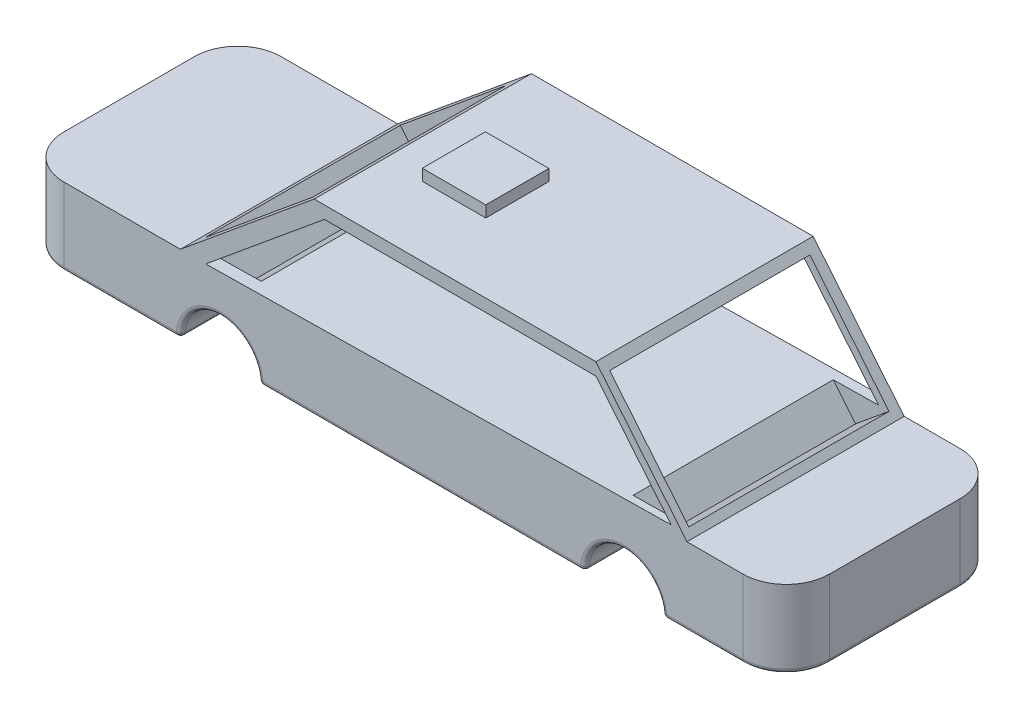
ISO-10303-21;
HEADER;
FILE_DESCRIPTION(('STEP AP214'),'2;1');
FILE_NAME('part.step','',(''),(''),'','','');
FILE_SCHEMA(('AUTOMOTIVE_DESIGN { 1 0 10303 214 1 1 1 1 }'));
ENDSEC;
DATA;
#1=APPLICATION_CONTEXT('core data for automotive mechanical design processes');
#2=APPLICATION_PROTOCOL_DEFINITION('international standard','automotive_design',2000,#1);
#3=PRODUCT_CONTEXT('',#1,'mechanical');
#4=PRODUCT('Part','Part','',(#3));
#5=PRODUCT_RELATED_PRODUCT_CATEGORY('part','',(#4));
#6=PRODUCT_DEFINITION_FORMATION('','',#4);
#7=PRODUCT_DEFINITION_CONTEXT('part definition',#1,'design');
#8=PRODUCT_DEFINITION('design','',#6,#7);
#9=PRODUCT_DEFINITION_SHAPE('','',#8);
#10=(LENGTH_UNIT() NAMED_UNIT(*) SI_UNIT(.MILLI.,.METRE.));
#11=(NAMED_UNIT(*) PLANE_ANGLE_UNIT() SI_UNIT($,.RADIAN.));
#12=(NAMED_UNIT(*) SI_UNIT($,.STERADIAN.) SOLID_ANGLE_UNIT());
#13=UNCERTAINTY_MEASURE_WITH_UNIT(LENGTH_MEASURE(1.E-05),#10,'distance_accuracy_value','');
#14=(GEOMETRIC_REPRESENTATION_CONTEXT(3) GLOBAL_UNCERTAINTY_ASSIGNED_CONTEXT((#13)) GLOBAL_UNIT_ASSIGNED_CONTEXT((#10,
#11,#12)) REPRESENTATION_CONTEXT('',''));
#15=CARTESIAN_POINT('',(0.,0.,0.));
#16=DIRECTION('',(0.,0.,1.));
#17=DIRECTION('',(1.,0.,0.));
#18=AXIS2_PLACEMENT_3D('',#15,#16,#17);
#19=CARTESIAN_POINT('',(47.7398636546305,-17.9652644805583,-40.1840361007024));
#20=DIRECTION('',(0.,-1.,0.));
#21=DIRECTION('',(0.,0.,-1.));
#22=AXIS2_PLACEMENT_3D('',#19,#20,#21);
#23=PLANE('',#22);
#24=DIRECTION('',(0.,0.,-1.));
#25=VECTOR('',#24,1.);
#26=CARTESIAN_POINT('',(0.239324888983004,-17.9652644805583,10.));
#27=LINE('',#26,#25);
#28=CARTESIAN_POINT('',(0.239324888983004,-17.9652644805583,-39.1840361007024));
#29=VERTEX_POINT('',#28);
#30=CARTESIAN_POINT('',(0.239324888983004,-17.9652644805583,9.));
#31=VERTEX_POINT('',#30);
#32=EDGE_CURVE('E606',#29,#31,#27,.F.);
#33=ORIENTED_EDGE('',*,*,#32,.T.);
#34=DIRECTION('',(1.,0.,0.));
#35=VECTOR('',#34,1.);
#36=CARTESIAN_POINT('',(-73.0657939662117,-17.9652644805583,9.));
#37=LINE('',#36,#35);
#38=CARTESIAN_POINT('',(-73.1156257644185,-17.9652644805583,9.));
#39=VERTEX_POINT('',#38);
#40=EDGE_CURVE('E11',#31,#39,#37,.F.);
#41=ORIENTED_EDGE('',*,*,#40,.T.);
#42=DIRECTION('',(0.,0.,-1.));
#43=VECTOR('',#42,1.);
#44=CARTESIAN_POINT('',(-73.1156257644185,-17.9652644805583,-40.1840361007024));
#45=LINE('',#44,#43);
#46=CARTESIAN_POINT('',(-73.1156257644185,-17.9652644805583,-39.1840361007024));
#47=VERTEX_POINT('',#46);
#48=EDGE_CURVE('E604',#39,#47,#45,.T.);
#49=ORIENTED_EDGE('',*,*,#48,.T.);
#50=DIRECTION('',(1.,0.,0.));
#51=VECTOR('',#50,1.);
#52=CARTESIAN_POINT('',(47.7398636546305,-17.9652644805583,-39.1840361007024));
#53=LINE('',#52,#51);
#54=EDGE_CURVE('E602',#47,#29,#53,.T.);
#55=ORIENTED_EDGE('',*,*,#54,.T.);
#56=EDGE_LOOP('',(#33,#41,#49,#55));
#57=FACE_BOUND('',#56,.T.);
#58=ADVANCED_FACE('F35',(#57),#23,.T.);
#59=CARTESIAN_POINT('',(37.7398636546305,-17.9652644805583,0.));
#60=DIRECTION('',(0.,-1.,0.));
#61=DIRECTION('',(0.,0.,-1.));
#62=AXIS2_PLACEMENT_3D('',#59,#60,#61);
#63=CIRCLE('',#62,9.);
#64=CARTESIAN_POINT('',(46.7398636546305,-17.9652644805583,0.));
#65=VERTEX_POINT('',#64);
#66=CARTESIAN_POINT('',(37.7398636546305,-17.9652644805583,9.));
#67=VERTEX_POINT('',#66);
#68=EDGE_CURVE('E687',#65,#67,#63,.T.);
#69=ORIENTED_EDGE('',*,*,#68,.T.);
#70=DIRECTION('',(1.,0.,0.));
#71=VECTOR('',#70,1.);
#72=CARTESIAN_POINT('',(20.209595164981,-17.9652644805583,9.));
#73=LINE('',#72,#71);
#74=CARTESIAN_POINT('',(20.1595207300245,-17.9652644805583,9.));
#75=VERTEX_POINT('',#74);
#76=EDGE_CURVE('E689',#67,#75,#73,.F.);
#77=ORIENTED_EDGE('',*,*,#76,.T.);
#78=DIRECTION('',(0.,0.,-1.));
#79=VECTOR('',#78,1.);
#80=CARTESIAN_POINT('',(20.1595207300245,-17.9652644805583,-40.1840361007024));
#81=LINE('',#80,#79);
#82=CARTESIAN_POINT('',(20.1595207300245,-17.9652644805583,-39.1840361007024));
#83=VERTEX_POINT('',#82);
#84=EDGE_CURVE('E592',#75,#83,#81,.T.);
#85=ORIENTED_EDGE('',*,*,#84,.T.);
#86=DIRECTION('',(1.,0.,0.));
#87=VECTOR('',#86,1.);
#88=CARTESIAN_POINT('',(47.7398636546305,-17.9652644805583,-39.1840361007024));
#89=LINE('',#88,#87);
#90=CARTESIAN_POINT('',(37.7398636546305,-17.9652644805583,-39.1840361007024));
#91=VERTEX_POINT('',#90);
#92=EDGE_CURVE('E681',#83,#91,#89,.T.);
#93=ORIENTED_EDGE('',*,*,#92,.T.);
#94=CARTESIAN_POINT('',(37.7398636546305,-17.9652644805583,-30.1840361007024));
#95=DIRECTION('',(0.,-1.,0.));
#96=DIRECTION('',(0.,0.,-1.));
#97=AXIS2_PLACEMENT_3D('',#94,#95,#96);
#98=CIRCLE('',#97,9.);
#99=CARTESIAN_POINT('',(46.7398636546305,-17.9652644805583,-30.1840361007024));
#100=VERTEX_POINT('',#99);
#101=EDGE_CURVE('E683',#91,#100,#98,.T.);
#102=ORIENTED_EDGE('',*,*,#101,.T.);
#103=DIRECTION('',(0.,0.,1.));
#104=VECTOR('',#103,1.);
#105=CARTESIAN_POINT('',(46.7398636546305,-17.9652644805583,-40.1840361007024));
#106=LINE('',#105,#104);
#107=EDGE_CURVE('E685',#100,#65,#106,.T.);
#108=ORIENTED_EDGE('',*,*,#107,.T.);
#109=EDGE_LOOP('',(#69,#77,#85,#93,#102,#108));
#110=FACE_BOUND('',#109,.T.);
#111=ADVANCED_FACE('F901',(#110),#23,.T.);
#112=CARTESIAN_POINT('',(-61.3080354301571,25.5031376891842,-40.1840361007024));
#113=DIRECTION('',(0.,1.,0.));
#114=DIRECTION('',(0.,0.,1.));
#115=AXIS2_PLACEMENT_3D('',#112,#113,#114);
#116=PLANE('',#115);
#117=DIRECTION('',(0.,0.,1.));
#118=VECTOR('',#117,1.);
#119=CARTESIAN_POINT('',(-61.3080354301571,25.5031376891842,-40.1840361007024));
#120=LINE('',#119,#118);
#121=CARTESIAN_POINT('',(-61.3080354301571,25.5031376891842,-40.1840361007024));
#122=VERTEX_POINT('',#121);
#123=CARTESIAN_POINT('',(-61.3080354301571,25.5031376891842,10.));
#124=VERTEX_POINT('',#123);
#125=EDGE_CURVE('E524',#122,#124,#120,.T.);
#126=ORIENTED_EDGE('',*,*,#125,.T.);
#127=DIRECTION('',(-1.,0.,0.));
#128=VECTOR('',#127,1.);
#129=CARTESIAN_POINT('',(-61.3080354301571,25.5031376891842,10.));
#130=LINE('',#129,#128);
#131=CARTESIAN_POINT('',(3.76893660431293,25.5031376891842,10.));
#132=VERTEX_POINT('',#131);
#133=EDGE_CURVE('E470',#132,#124,#130,.T.);
#134=ORIENTED_EDGE('',*,*,#133,.F.);
#135=DIRECTION('',(0.,0.,1.));
#136=VECTOR('',#135,1.);
#137=CARTESIAN_POINT('',(3.76893660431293,25.5031376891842,-40.1840361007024));
#138=LINE('',#137,#136);
#139=CARTESIAN_POINT('',(3.76893660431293,25.5031376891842,-40.1840361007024));
#140=VERTEX_POINT('',#139);
#141=EDGE_CURVE('E526',#140,#132,#138,.T.);
#142=ORIENTED_EDGE('',*,*,#141,.F.);
#143=DIRECTION('',(-1.,0.,0.));
#144=VECTOR('',#143,1.);
#145=CARTESIAN_POINT('',(-61.3080354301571,25.5031376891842,-40.1840361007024));
#146=LINE('',#145,#144);
#147=EDGE_CURVE('E508',#140,#122,#146,.T.);
#148=ORIENTED_EDGE('',*,*,#147,.T.);
#149=EDGE_LOOP('',(#126,#134,#142,#148));
#150=FACE_BOUND('',#149,.T.);
#151=DIRECTION('',(1.,0.,0.));
#152=VECTOR('',#151,1.);
#153=CARTESIAN_POINT('',(-52.3700011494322,25.5031376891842,-6.0329635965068));
#154=LINE('',#153,#152);
#155=CARTESIAN_POINT('',(-52.3700011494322,25.5031376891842,-6.0329635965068));
#156=VERTEX_POINT('',#155);
#157=CARTESIAN_POINT('',(-37.6997689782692,25.5031376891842,-6.0329635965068));
#158=VERTEX_POINT('',#157);
#159=EDGE_CURVE('E404',#156,#158,#154,.T.);
#160=ORIENTED_EDGE('',*,*,#159,.F.);
#161=DIRECTION('',(0.,0.,1.));
#162=VECTOR('',#161,1.);
#163=CARTESIAN_POINT('',(-52.3700011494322,25.5031376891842,-20.6020264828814));
#164=LINE('',#163,#162);
#165=CARTESIAN_POINT('',(-52.3700011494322,25.5031376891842,-20.6020264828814));
#166=VERTEX_POINT('',#165);
#167=EDGE_CURVE('E390',#166,#156,#164,.T.);
#168=ORIENTED_EDGE('',*,*,#167,.F.);
#169=DIRECTION('',(-1.,0.,0.));
#170=VECTOR('',#169,1.);
#171=CARTESIAN_POINT('',(-52.3700011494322,25.5031376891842,-20.6020264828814));
#172=LINE('',#171,#170);
#173=CARTESIAN_POINT('',(-37.6997689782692,25.5031376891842,-20.6020264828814));
#174=VERTEX_POINT('',#173);
#175=EDGE_CURVE('E395',#174,#166,#172,.T.);
#176=ORIENTED_EDGE('',*,*,#175,.F.);
#177=DIRECTION('',(0.,0.,-1.));
#178=VECTOR('',#177,1.);
#179=CARTESIAN_POINT('',(-37.6997689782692,25.5031376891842,-20.6020264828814));
#180=LINE('',#179,#178);
#181=EDGE_CURVE('E406',#158,#174,#180,.T.);
#182=ORIENTED_EDGE('',*,*,#181,.F.);
#183=EDGE_LOOP('',(#160,#168,#176,#182));
#184=FACE_BOUND('',#183,.T.);
#185=ADVANCED_FACE('F809',(#150,#184),#116,.T.);
#186=CARTESIAN_POINT('',(-129.14889430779,-17.9652644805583,-40.1840361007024));
#187=DIRECTION('',(-1.,0.,0.));
#188=DIRECTION('',(0.,0.,1.));
#189=AXIS2_PLACEMENT_3D('',#186,#187,#188);
#190=PLANE('',#189);
#191=DIRECTION('',(0.,-1.,0.));
#192=VECTOR('',#191,1.);
#193=CARTESIAN_POINT('',(-129.14889430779,-17.9652644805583,-30.1840361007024));
#194=LINE('',#193,#192);
#195=CARTESIAN_POINT('',(-129.14889430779,0.,-30.1840361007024));
#196=VERTEX_POINT('',#195);
#197=CARTESIAN_POINT('',(-129.14889430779,-16.9652644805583,-30.1840361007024));
#198=VERTEX_POINT('',#197);
#199=EDGE_CURVE('E547',#196,#198,#194,.T.);
#200=ORIENTED_EDGE('',*,*,#199,.T.);
#201=DIRECTION('',(0.,0.,1.));
#202=VECTOR('',#201,1.);
#203=CARTESIAN_POINT('',(-129.14889430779,-16.9652644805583,-40.1840361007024));
#204=LINE('',#203,#202);
#205=CARTESIAN_POINT('',(-129.14889430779,-16.9652644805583,0.));
#206=VERTEX_POINT('',#205);
#207=EDGE_CURVE('E667',#198,#206,#204,.T.);
#208=ORIENTED_EDGE('',*,*,#207,.T.);
#209=DIRECTION('',(0.,-1.,0.));
#210=VECTOR('',#209,1.);
#211=CARTESIAN_POINT('',(-129.14889430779,0.,0.));
#212=LINE('',#211,#210);
#213=CARTESIAN_POINT('',(-129.14889430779,0.,0.));
#214=VERTEX_POINT('',#213);
#215=EDGE_CURVE('E550',#206,#214,#212,.F.);
#216=ORIENTED_EDGE('',*,*,#215,.T.);
#217=DIRECTION('',(0.,0.,1.));
#218=VECTOR('',#217,1.);
#219=CARTESIAN_POINT('',(-129.14889430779,0.,-40.1840361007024));
#220=LINE('',#219,#218);
#221=EDGE_CURVE('E518',#196,#214,#220,.T.);
#222=ORIENTED_EDGE('',*,*,#221,.F.);
#223=EDGE_LOOP('',(#200,#208,#216,#222));
#224=FACE_BOUND('',#223,.T.);
#225=ADVANCED_FACE('F833',(#224),#190,.T.);
#226=CARTESIAN_POINT('',(-129.14889430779,0.,-40.1840361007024));
#227=DIRECTION('',(0.,1.,0.));
#228=DIRECTION('',(0.,0.,1.));
#229=AXIS2_PLACEMENT_3D('',#226,#227,#228);
#230=PLANE('',#229);
#231=ORIENTED_EDGE('',*,*,#221,.T.);
#232=CARTESIAN_POINT('',(-119.14889430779,0.,0.));
#233=DIRECTION('',(0.,1.,0.));
#234=DIRECTION('',(0.,0.,1.));
#235=AXIS2_PLACEMENT_3D('',#232,#233,#234);
#236=CIRCLE('',#235,10.);
#237=CARTESIAN_POINT('',(-119.14889430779,0.,10.));
#238=VERTEX_POINT('',#237);
#239=EDGE_CURVE('E554',#214,#238,#236,.T.);
#240=ORIENTED_EDGE('',*,*,#239,.T.);
#241=DIRECTION('',(-1.,0.,0.));
#242=VECTOR('',#241,1.);
#243=CARTESIAN_POINT('',(-129.14889430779,0.,10.));
#244=LINE('',#243,#242);
#245=CARTESIAN_POINT('',(-92.2133155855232,0.,10.));
#246=VERTEX_POINT('',#245);
#247=EDGE_CURVE('E476',#246,#238,#244,.T.);
#248=ORIENTED_EDGE('',*,*,#247,.F.);
#249=DIRECTION('',(0.,0.,1.));
#250=VECTOR('',#249,1.);
#251=CARTESIAN_POINT('',(-92.2133155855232,0.,-40.1840361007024));
#252=LINE('',#251,#250);
#253=CARTESIAN_POINT('',(-92.2133155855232,0.,-40.1840361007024));
#254=VERTEX_POINT('',#253);
#255=EDGE_CURVE('E522',#254,#246,#252,.T.);
#256=ORIENTED_EDGE('',*,*,#255,.F.);
#257=DIRECTION('',(-1.,0.,0.));
#258=VECTOR('',#257,1.);
#259=CARTESIAN_POINT('',(-129.14889430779,0.,-40.1840361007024));
#260=LINE('',#259,#258);
#261=CARTESIAN_POINT('',(-119.14889430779,0.,-40.1840361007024));
#262=VERTEX_POINT('',#261);
#263=EDGE_CURVE('E514',#254,#262,#260,.T.);
#264=ORIENTED_EDGE('',*,*,#263,.T.);
#265=CARTESIAN_POINT('',(-119.14889430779,0.,-30.1840361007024));
#266=DIRECTION('',(0.,1.,0.));
#267=DIRECTION('',(0.,0.,1.));
#268=AXIS2_PLACEMENT_3D('',#265,#266,#267);
#269=CIRCLE('',#268,10.);
#270=EDGE_CURVE('E552',#262,#196,#269,.T.);
#271=ORIENTED_EDGE('',*,*,#270,.T.);
#272=EDGE_LOOP('',(#231,#240,#248,#256,#264,#271));
#273=FACE_BOUND('',#272,.T.);
#274=ADVANCED_FACE('F823',(#273),#230,.T.);
#275=CARTESIAN_POINT('',(-92.2133155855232,0.,-40.1840361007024));
#276=DIRECTION('',(-0.636476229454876,0.771296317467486,0.));
#277=DIRECTION('',(-0.771296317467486,-0.636476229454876,0.));
#278=AXIS2_PLACEMENT_3D('',#275,#276,#277);
#279=PLANE('',#278);
#280=DIRECTION('',(-0.771296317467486,-0.636476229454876,0.));
#281=VECTOR('',#280,1.);
#282=CARTESIAN_POINT('',(-88.940855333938,2.70044484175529,-37.5178723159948));
#283=LINE('',#282,#281);
#284=CARTESIAN_POINT('',(-64.5525227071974,22.8257762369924,-37.5178723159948));
#285=VERTEX_POINT('',#284);
#286=CARTESIAN_POINT('',(-88.940855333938,2.70044484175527,-37.5178723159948));
#287=VERTEX_POINT('',#286);
#288=EDGE_CURVE('E419',#285,#287,#283,.T.);
#289=ORIENTED_EDGE('',*,*,#288,.F.);
#290=DIRECTION('',(0.,0.,-1.));
#291=VECTOR('',#290,1.);
#292=CARTESIAN_POINT('',(-64.5525227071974,22.8257762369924,-37.5178723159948));
#293=LINE('',#292,#291);
#294=CARTESIAN_POINT('',(-64.5525227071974,22.8257762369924,7.21855711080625));
#295=VERTEX_POINT('',#294);
#296=EDGE_CURVE('E423',#295,#285,#293,.T.);
#297=ORIENTED_EDGE('',*,*,#296,.F.);
#298=DIRECTION('',(0.771296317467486,0.636476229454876,0.));
#299=VECTOR('',#298,1.);
#300=CARTESIAN_POINT('',(-64.5525227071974,22.8257762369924,7.21855711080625));
#301=LINE('',#300,#299);
#302=CARTESIAN_POINT('',(-89.234690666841,2.45797096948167,7.21855711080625));
#303=VERTEX_POINT('',#302);
#304=EDGE_CURVE('E434',#303,#295,#301,.T.);
#305=ORIENTED_EDGE('',*,*,#304,.F.);
#306=DIRECTION('',(-0.00656790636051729,-0.00541985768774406,0.999963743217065));
#307=VECTOR('',#306,1.);
#308=CARTESIAN_POINT('',(-89.234690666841,2.45797096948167,7.21855711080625));
#309=LINE('',#308,#307);
#310=EDGE_CURVE('E431',#287,#303,#309,.T.);
#311=ORIENTED_EDGE('',*,*,#310,.F.);
#312=EDGE_LOOP('',(#289,#297,#305,#311));
#313=FACE_BOUND('',#312,.T.);
#314=ORIENTED_EDGE('',*,*,#255,.T.);
#315=DIRECTION('',(-0.771296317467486,-0.636476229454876,0.));
#316=VECTOR('',#315,1.);
#317=CARTESIAN_POINT('',(-92.2133155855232,0.,10.));
#318=LINE('',#317,#316);
#319=EDGE_CURVE('E473',#124,#246,#318,.T.);
#320=ORIENTED_EDGE('',*,*,#319,.F.);
#321=ORIENTED_EDGE('',*,*,#125,.F.);
#322=DIRECTION('',(-0.771296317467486,-0.636476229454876,0.));
#323=VECTOR('',#322,1.);
#324=CARTESIAN_POINT('',(-92.2133155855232,0.,-40.1840361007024));
#325=LINE('',#324,#323);
#326=EDGE_CURVE('E511',#122,#254,#325,.T.);
#327=ORIENTED_EDGE('',*,*,#326,.T.);
#328=EDGE_LOOP('',(#314,#320,#321,#327));
#329=FACE_BOUND('',#328,.T.);
#330=ADVANCED_FACE('F814',(#313,#329),#279,.T.);
#331=CARTESIAN_POINT('',(3.76893660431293,25.5031376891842,-40.1840361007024));
#332=DIRECTION('',(0.771296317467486,0.636476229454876,0.));
#333=DIRECTION('',(-0.636476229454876,0.771296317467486,0.));
#334=AXIS2_PLACEMENT_3D('',#331,#332,#333);
#335=PLANE('',#334);
#336=DIRECTION('',(0.636476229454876,-0.771296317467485,0.));
#337=VECTOR('',#336,1.);
#338=CARTESIAN_POINT('',(5.28984598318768,23.6600652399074,8.33171045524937));
#339=LINE('',#338,#337);
#340=CARTESIAN_POINT('',(5.28984598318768,23.6600652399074,8.33171045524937));
#341=VERTEX_POINT('',#340);
#342=CARTESIAN_POINT('',(23.564855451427,1.51399465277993,8.33171045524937));
#343=VERTEX_POINT('',#342);
#344=EDGE_CURVE('E358',#341,#343,#339,.T.);
#345=ORIENTED_EDGE('',*,*,#344,.F.);
#346=DIRECTION('',(0.,0.,1.));
#347=VECTOR('',#346,1.);
#348=CARTESIAN_POINT('',(5.28984598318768,23.6600652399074,8.33171045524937));
#349=LINE('',#348,#347);
#350=CARTESIAN_POINT('',(5.28984598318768,23.6600652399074,-37.9073380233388));
#351=VERTEX_POINT('',#350);
#352=EDGE_CURVE('E352',#351,#341,#349,.T.);
#353=ORIENTED_EDGE('',*,*,#352,.F.);
#354=DIRECTION('',(-0.636476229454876,0.771296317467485,0.));
#355=VECTOR('',#354,1.);
#356=CARTESIAN_POINT('',(5.28984598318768,23.6600652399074,-37.9073380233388));
#357=LINE('',#356,#355);
#358=CARTESIAN_POINT('',(23.564855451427,1.51399465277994,-37.9073380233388));
#359=VERTEX_POINT('',#358);
#360=EDGE_CURVE('E374',#359,#351,#357,.T.);
#361=ORIENTED_EDGE('',*,*,#360,.F.);
#362=DIRECTION('',(0.,0.,-1.));
#363=VECTOR('',#362,1.);
#364=CARTESIAN_POINT('',(23.564855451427,1.51399465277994,8.33171045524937));
#365=LINE('',#364,#363);
#366=EDGE_CURVE('E371',#343,#359,#365,.T.);
#367=ORIENTED_EDGE('',*,*,#366,.F.);
#368=EDGE_LOOP('',(#345,#353,#361,#367));
#369=FACE_BOUND('',#368,.T.);
#370=ORIENTED_EDGE('',*,*,#141,.T.);
#371=DIRECTION('',(-0.636476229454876,0.771296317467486,0.));
#372=VECTOR('',#371,1.);
#373=CARTESIAN_POINT('',(3.76893660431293,25.5031376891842,10.));
#374=LINE('',#373,#372);
#375=CARTESIAN_POINT('',(24.8142087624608,0.,10.));
#376=VERTEX_POINT('',#375);
#377=EDGE_CURVE('E467',#376,#132,#374,.T.);
#378=ORIENTED_EDGE('',*,*,#377,.F.);
#379=DIRECTION('',(0.,0.,1.));
#380=VECTOR('',#379,1.);
#381=CARTESIAN_POINT('',(24.8142087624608,0.,-40.1840361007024));
#382=LINE('',#381,#380);
#383=CARTESIAN_POINT('',(24.8142087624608,0.,-40.1840361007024));
#384=VERTEX_POINT('',#383);
#385=EDGE_CURVE('E528',#384,#376,#382,.T.);
#386=ORIENTED_EDGE('',*,*,#385,.F.);
#387=DIRECTION('',(-0.636476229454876,0.771296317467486,0.));
#388=VECTOR('',#387,1.);
#389=CARTESIAN_POINT('',(3.76893660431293,25.5031376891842,-40.1840361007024));
#390=LINE('',#389,#388);
#391=EDGE_CURVE('E505',#384,#140,#390,.T.);
#392=ORIENTED_EDGE('',*,*,#391,.T.);
#393=EDGE_LOOP('',(#370,#378,#386,#392));
#394=FACE_BOUND('',#393,.T.);
#395=ADVANCED_FACE('F922',(#369,#394),#335,.T.);
#396=CARTESIAN_POINT('',(24.8142087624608,0.,-40.1840361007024));
#397=DIRECTION('',(0.,1.,0.));
#398=DIRECTION('',(-1.,0.,0.));
#399=AXIS2_PLACEMENT_3D('',#396,#397,#398);
#400=PLANE('',#399);
#401=DIRECTION('',(0.,0.,1.));
#402=VECTOR('',#401,1.);
#403=CARTESIAN_POINT('',(47.7398636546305,0.,-40.1840361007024));
#404=LINE('',#403,#402);
#405=CARTESIAN_POINT('',(47.7398636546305,0.,-30.1840361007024));
#406=VERTEX_POINT('',#405);
#407=CARTESIAN_POINT('',(47.7398636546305,0.,0.));
#408=VERTEX_POINT('',#407);
#409=EDGE_CURVE('E517',#406,#408,#404,.T.);
#410=ORIENTED_EDGE('',*,*,#409,.F.);
#411=CARTESIAN_POINT('',(37.7398636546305,0.,-30.1840361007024));
#412=DIRECTION('',(0.,1.,0.));
#413=DIRECTION('',(-1.,0.,0.));
#414=AXIS2_PLACEMENT_3D('',#411,#412,#413);
#415=CIRCLE('',#414,10.);
#416=CARTESIAN_POINT('',(37.7398636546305,0.,-40.1840361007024));
#417=VERTEX_POINT('',#416);
#418=EDGE_CURVE('E565',#406,#417,#415,.T.);
#419=ORIENTED_EDGE('',*,*,#418,.T.);
#420=DIRECTION('',(-1.,0.,0.));
#421=VECTOR('',#420,1.);
#422=CARTESIAN_POINT('',(24.8142087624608,0.,-40.1840361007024));
#423=LINE('',#422,#421);
#424=EDGE_CURVE('E494',#417,#384,#423,.T.);
#425=ORIENTED_EDGE('',*,*,#424,.T.);
#426=ORIENTED_EDGE('',*,*,#385,.T.);
#427=DIRECTION('',(-1.,0.,0.));
#428=VECTOR('',#427,1.);
#429=CARTESIAN_POINT('',(24.8142087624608,0.,10.));
#430=LINE('',#429,#428);
#431=CARTESIAN_POINT('',(37.7398636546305,0.,10.));
#432=VERTEX_POINT('',#431);
#433=EDGE_CURVE('E465',#432,#376,#430,.T.);
#434=ORIENTED_EDGE('',*,*,#433,.F.);
#435=CARTESIAN_POINT('',(37.7398636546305,0.,0.));
#436=DIRECTION('',(0.,1.,0.));
#437=DIRECTION('',(-1.,0.,0.));
#438=AXIS2_PLACEMENT_3D('',#435,#436,#437);
#439=CIRCLE('',#438,10.);
#440=EDGE_CURVE('E563',#432,#408,#439,.T.);
#441=ORIENTED_EDGE('',*,*,#440,.T.);
#442=EDGE_LOOP('',(#410,#419,#425,#426,#434,#441));
#443=FACE_BOUND('',#442,.T.);
#444=ADVANCED_FACE('F802',(#443),#400,.T.);
#445=CARTESIAN_POINT('',(47.7398636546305,0.,-40.1840361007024));
#446=DIRECTION('',(1.,0.,0.));
#447=DIRECTION('',(0.,0.,-1.));
#448=AXIS2_PLACEMENT_3D('',#445,#446,#447);
#449=PLANE('',#448);
#450=DIRECTION('',(0.,1.,0.));
#451=VECTOR('',#450,1.);
#452=CARTESIAN_POINT('',(47.7398636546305,-17.9652644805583,0.));
#453=LINE('',#452,#451);
#454=CARTESIAN_POINT('',(47.7398636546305,-16.9652644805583,0.));
#455=VERTEX_POINT('',#454);
#456=EDGE_CURVE('E558',#408,#455,#453,.F.);
#457=ORIENTED_EDGE('',*,*,#456,.T.);
#458=DIRECTION('',(0.,0.,1.));
#459=VECTOR('',#458,1.);
#460=CARTESIAN_POINT('',(47.7398636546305,-16.9652644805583,-40.1840361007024));
#461=LINE('',#460,#459);
#462=CARTESIAN_POINT('',(47.7398636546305,-16.9652644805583,-30.1840361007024));
#463=VERTEX_POINT('',#462);
#464=EDGE_CURVE('E699',#455,#463,#461,.F.);
#465=ORIENTED_EDGE('',*,*,#464,.T.);
#466=DIRECTION('',(0.,1.,0.));
#467=VECTOR('',#466,1.);
#468=CARTESIAN_POINT('',(47.7398636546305,0.,-30.1840361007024));
#469=LINE('',#468,#467);
#470=EDGE_CURVE('E561',#463,#406,#469,.T.);
#471=ORIENTED_EDGE('',*,*,#470,.T.);
#472=ORIENTED_EDGE('',*,*,#409,.T.);
#473=EDGE_LOOP('',(#457,#465,#471,#472));
#474=FACE_BOUND('',#473,.T.);
#475=ADVANCED_FACE('F911',(#474),#449,.T.);
#476=DIRECTION('',(0.,0.,-1.));
#477=VECTOR('',#476,1.);
#478=CARTESIAN_POINT('',(-93.1333017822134,-17.9652644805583,10.));
#479=LINE('',#478,#477);
#480=CARTESIAN_POINT('',(-93.1333017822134,-17.9652644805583,-39.1840361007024));
#481=VERTEX_POINT('',#480);
#482=CARTESIAN_POINT('',(-93.1333017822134,-17.9652644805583,9.));
#483=VERTEX_POINT('',#482);
#484=EDGE_CURVE('E624',#481,#483,#479,.F.);
#485=ORIENTED_EDGE('',*,*,#484,.T.);
#486=DIRECTION('',(1.,0.,0.));
#487=VECTOR('',#486,1.);
#488=CARTESIAN_POINT('',(-119.14889430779,-17.9652644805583,9.));
#489=LINE('',#488,#487);
#490=CARTESIAN_POINT('',(-119.14889430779,-17.9652644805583,9.));
#491=VERTEX_POINT('',#490);
#492=EDGE_CURVE('E663',#483,#491,#489,.F.);
#493=ORIENTED_EDGE('',*,*,#492,.T.);
#494=CARTESIAN_POINT('',(-119.14889430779,-17.9652644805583,0.));
#495=DIRECTION('',(0.,-1.,0.));
#496=DIRECTION('',(0.,0.,-1.));
#497=AXIS2_PLACEMENT_3D('',#494,#495,#496);
#498=CIRCLE('',#497,9.);
#499=CARTESIAN_POINT('',(-128.14889430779,-17.9652644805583,0.));
#500=VERTEX_POINT('',#499);
#501=EDGE_CURVE('E661',#491,#500,#498,.T.);
#502=ORIENTED_EDGE('',*,*,#501,.T.);
#503=DIRECTION('',(0.,0.,1.));
#504=VECTOR('',#503,1.);
#505=CARTESIAN_POINT('',(-128.14889430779,-17.9652644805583,-40.1840361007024));
#506=LINE('',#505,#504);
#507=CARTESIAN_POINT('',(-128.14889430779,-17.9652644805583,-30.1840361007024));
#508=VERTEX_POINT('',#507);
#509=EDGE_CURVE('E659',#500,#508,#506,.F.);
#510=ORIENTED_EDGE('',*,*,#509,.T.);
#511=CARTESIAN_POINT('',(-119.14889430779,-17.9652644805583,-30.1840361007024));
#512=DIRECTION('',(0.,-1.,0.));
#513=DIRECTION('',(0.,0.,-1.));
#514=AXIS2_PLACEMENT_3D('',#511,#512,#513);
#515=CIRCLE('',#514,9.);
#516=CARTESIAN_POINT('',(-119.14889430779,-17.9652644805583,-39.1840361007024));
#517=VERTEX_POINT('',#516);
#518=EDGE_CURVE('E657',#508,#517,#515,.T.);
#519=ORIENTED_EDGE('',*,*,#518,.T.);
#520=DIRECTION('',(1.,0.,0.));
#521=VECTOR('',#520,1.);
#522=CARTESIAN_POINT('',(47.7398636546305,-17.9652644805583,-39.1840361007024));
#523=LINE('',#522,#521);
#524=EDGE_CURVE('E655',#517,#481,#523,.T.);
#525=ORIENTED_EDGE('',*,*,#524,.T.);
#526=EDGE_LOOP('',(#485,#493,#502,#510,#519,#525));
#527=FACE_BOUND('',#526,.T.);
#528=ADVANCED_FACE('F870',(#527),#23,.T.);
#529=CARTESIAN_POINT('',(0.,0.,-40.1840361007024));
#530=DIRECTION('',(0.,0.,-1.));
#531=DIRECTION('',(-1.,0.,0.));
#532=AXIS2_PLACEMENT_3D('',#529,#530,#531);
#533=PLANE('',#532);
#534=CARTESIAN_POINT('',(-83.1244637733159,-17.9652644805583,-40.1840361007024));
#535=DIRECTION('',(0.,0.,-1.));
#536=DIRECTION('',(-1.,0.,0.));
#537=AXIS2_PLACEMENT_3D('',#534,#535,#536);
#538=CIRCLE('',#537,10.0586698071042);
#539=CARTESIAN_POINT('',(-73.1156257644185,-16.9652644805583,-40.1840361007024));
#540=VERTEX_POINT('',#539);
#541=CARTESIAN_POINT('',(-93.1333017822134,-16.9652644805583,-40.1840361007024));
#542=VERTEX_POINT('',#541);
#543=EDGE_CURVE('E597',#540,#542,#538,.F.);
#544=ORIENTED_EDGE('',*,*,#543,.T.);
#545=DIRECTION('',(1.,0.,0.));
#546=VECTOR('',#545,1.);
#547=CARTESIAN_POINT('',(0.,-16.9652644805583,-40.1840361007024));
#548=LINE('',#547,#546);
#549=CARTESIAN_POINT('',(-119.14889430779,-16.9652644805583,-40.1840361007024));
#550=VERTEX_POINT('',#549);
#551=EDGE_CURVE('E695',#542,#550,#548,.F.);
#552=ORIENTED_EDGE('',*,*,#551,.T.);
#553=DIRECTION('',(0.,-1.,0.));
#554=VECTOR('',#553,1.);
#555=CARTESIAN_POINT('',(-119.14889430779,0.,-40.1840361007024));
#556=LINE('',#555,#554);
#557=EDGE_CURVE('E556',#550,#262,#556,.F.);
#558=ORIENTED_EDGE('',*,*,#557,.T.);
#559=ORIENTED_EDGE('',*,*,#263,.F.);
#560=ORIENTED_EDGE('',*,*,#326,.F.);
#561=ORIENTED_EDGE('',*,*,#147,.F.);
#562=ORIENTED_EDGE('',*,*,#391,.F.);
#563=ORIENTED_EDGE('',*,*,#424,.F.);
#564=DIRECTION('',(0.,1.,0.));
#565=VECTOR('',#564,1.);
#566=CARTESIAN_POINT('',(37.7398636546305,0.,-40.1840361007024));
#567=LINE('',#566,#565);
#568=CARTESIAN_POINT('',(37.7398636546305,-16.9652644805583,-40.1840361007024));
#569=VERTEX_POINT('',#568);
#570=EDGE_CURVE('E567',#417,#569,#567,.F.);
#571=ORIENTED_EDGE('',*,*,#570,.T.);
#572=DIRECTION('',(1.,0.,0.));
#573=VECTOR('',#572,1.);
#574=CARTESIAN_POINT('',(0.,-16.9652644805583,-40.1840361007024));
#575=LINE('',#574,#573);
#576=CARTESIAN_POINT('',(20.1595207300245,-16.9652644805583,-40.1840361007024));
#577=VERTEX_POINT('',#576);
#578=EDGE_CURVE('E693',#569,#577,#575,.F.);
#579=ORIENTED_EDGE('',*,*,#578,.T.);
#580=CARTESIAN_POINT('',(10.1994228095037,-17.9652644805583,-40.1840361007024));
#581=DIRECTION('',(0.,0.,-1.));
#582=DIRECTION('',(-1.,0.,0.));
#583=AXIS2_PLACEMENT_3D('',#580,#581,#582);
#584=CIRCLE('',#583,10.0101723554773);
#585=CARTESIAN_POINT('',(0.239324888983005,-16.9652644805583,-40.1840361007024));
#586=VERTEX_POINT('',#585);
#587=EDGE_CURVE('E600',#577,#586,#584,.F.);
#588=ORIENTED_EDGE('',*,*,#587,.T.);
#589=DIRECTION('',(1.,0.,0.));
#590=VECTOR('',#589,1.);
#591=CARTESIAN_POINT('',(0.,-16.9652644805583,-40.1840361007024));
#592=LINE('',#591,#590);
#593=EDGE_CURVE('E595',#586,#540,#592,.F.);
#594=ORIENTED_EDGE('',*,*,#593,.T.);
#595=EDGE_LOOP('',(#544,#552,#558,#559,#560,#561,#562,#563,#571,#579,#588,#594));
#596=FACE_BOUND('',#595,.T.);
#597=DIRECTION('',(-1.,0.,0.));
#598=VECTOR('',#597,1.);
#599=CARTESIAN_POINT('',(-58.9333416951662,22.6254300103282,-40.1840361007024));
#600=LINE('',#599,#598);
#601=CARTESIAN_POINT('',(3.76893660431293,22.6254300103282,-40.1840361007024));
#602=VERTEX_POINT('',#601);
#603=CARTESIAN_POINT('',(-58.9333416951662,22.6254300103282,-40.1840361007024));
#604=VERTEX_POINT('',#603);
#605=EDGE_CURVE('E479',#602,#604,#600,.T.);
#606=ORIENTED_EDGE('',*,*,#605,.T.);
#607=DIRECTION('',(-0.771296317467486,-0.636476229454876,0.));
#608=VECTOR('',#607,1.);
#609=CARTESIAN_POINT('',(-58.9333416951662,22.6254300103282,-40.1840361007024));
#610=LINE('',#609,#608);
#611=CARTESIAN_POINT('',(-86.351350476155,0.,-40.1840361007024));
#612=VERTEX_POINT('',#611);
#613=EDGE_CURVE('E482',#604,#612,#610,.T.);
#614=ORIENTED_EDGE('',*,*,#613,.T.);
#615=DIRECTION('',(0.999896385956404,0.0143950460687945,0.));
#616=VECTOR('',#615,1.);
#617=CARTESIAN_POINT('',(21.1622459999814,1.54782355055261,-40.1840361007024));
#618=LINE('',#617,#616);
#619=CARTESIAN_POINT('',(21.1622459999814,1.54782355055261,-40.1840361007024));
#620=VERTEX_POINT('',#619);
#621=EDGE_CURVE('E485',#612,#620,#618,.T.);
#622=ORIENTED_EDGE('',*,*,#621,.T.);
#623=DIRECTION('',(-0.636476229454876,0.771296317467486,0.));
#624=VECTOR('',#623,1.);
#625=CARTESIAN_POINT('',(3.76893660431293,22.6254300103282,-40.1840361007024));
#626=LINE('',#625,#624);
#627=EDGE_CURVE('E488',#620,#602,#626,.T.);
#628=ORIENTED_EDGE('',*,*,#627,.T.);
#629=EDGE_LOOP('',(#606,#614,#622,#628));
#630=FACE_BOUND('',#629,.T.);
#631=ADVANCED_FACE('F817',(#596,#630),#533,.T.);
#632=CARTESIAN_POINT('',(-58.9333416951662,22.6254300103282,-40.1840361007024));
#633=DIRECTION('',(0.,1.,0.));
#634=DIRECTION('',(0.,0.,1.));
#635=AXIS2_PLACEMENT_3D('',#632,#633,#634);
#636=PLANE('',#635);
#637=DIRECTION('',(0.,0.,1.));
#638=VECTOR('',#637,1.);
#639=CARTESIAN_POINT('',(3.76893660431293,22.6254300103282,-40.1840361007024));
#640=LINE('',#639,#638);
#641=CARTESIAN_POINT('',(3.76893660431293,22.6254300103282,10.));
#642=VERTEX_POINT('',#641);
#643=EDGE_CURVE('E492',#602,#642,#640,.T.);
#644=ORIENTED_EDGE('',*,*,#643,.T.);
#645=DIRECTION('',(-1.,0.,0.));
#646=VECTOR('',#645,1.);
#647=CARTESIAN_POINT('',(-58.9333416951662,22.6254300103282,10.));
#648=LINE('',#647,#646);
#649=CARTESIAN_POINT('',(-58.9333416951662,22.6254300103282,10.));
#650=VERTEX_POINT('',#649);
#651=EDGE_CURVE('E453',#642,#650,#648,.T.);
#652=ORIENTED_EDGE('',*,*,#651,.T.);
#653=DIRECTION('',(0.,0.,1.));
#654=VECTOR('',#653,1.);
#655=CARTESIAN_POINT('',(-58.9333416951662,22.6254300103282,-40.1840361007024));
#656=LINE('',#655,#654);
#657=EDGE_CURVE('E491',#604,#650,#656,.T.);
#658=ORIENTED_EDGE('',*,*,#657,.F.);
#659=ORIENTED_EDGE('',*,*,#605,.F.);
#660=EDGE_LOOP('',(#644,#652,#658,#659));
#661=FACE_BOUND('',#660,.T.);
#662=ADVANCED_FACE('F916',(#661),#636,.F.);
#663=CARTESIAN_POINT('',(3.76893660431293,22.6254300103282,-40.1840361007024));
#664=DIRECTION('',(0.771296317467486,0.636476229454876,0.));
#665=DIRECTION('',(-0.636476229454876,0.771296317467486,0.));
#666=AXIS2_PLACEMENT_3D('',#663,#664,#665);
#667=PLANE('',#666);
#668=DIRECTION('',(0.,0.,1.));
#669=VECTOR('',#668,1.);
#670=CARTESIAN_POINT('',(3.877145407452,22.4943001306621,-40.1840361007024));
#671=LINE('',#670,#669);
#672=CARTESIAN_POINT('',(3.877145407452,22.4943001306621,-37.9073380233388));
#673=VERTEX_POINT('',#672);
#674=CARTESIAN_POINT('',(3.877145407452,22.4943001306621,8.33171045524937));
#675=VERTEX_POINT('',#674);
#676=EDGE_CURVE('E578',#673,#675,#671,.T.);
#677=ORIENTED_EDGE('',*,*,#676,.T.);
#678=DIRECTION('',(0.636476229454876,-0.771296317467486,0.));
#679=VECTOR('',#678,1.);
#680=CARTESIAN_POINT('',(3.76893660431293,22.6254300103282,8.33171045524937));
#681=LINE('',#680,#679);
#682=CARTESIAN_POINT('',(21.1622459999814,1.54782355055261,8.33171045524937));
#683=VERTEX_POINT('',#682);
#684=EDGE_CURVE('E387',#675,#683,#681,.T.);
#685=ORIENTED_EDGE('',*,*,#684,.T.);
#686=DIRECTION('',(0.,0.,1.));
#687=VECTOR('',#686,1.);
#688=CARTESIAN_POINT('',(21.1622459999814,1.54782355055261,-40.1840361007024));
#689=LINE('',#688,#687);
#690=CARTESIAN_POINT('',(21.1622459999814,1.54782355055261,10.));
#691=VERTEX_POINT('',#690);
#692=EDGE_CURVE('E498',#683,#691,#689,.T.);
#693=ORIENTED_EDGE('',*,*,#692,.T.);
#694=DIRECTION('',(-0.636476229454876,0.771296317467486,0.));
#695=VECTOR('',#694,1.);
#696=CARTESIAN_POINT('',(3.76893660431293,22.6254300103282,10.));
#697=LINE('',#696,#695);
#698=EDGE_CURVE('E462',#691,#642,#697,.T.);
#699=ORIENTED_EDGE('',*,*,#698,.T.);
#700=ORIENTED_EDGE('',*,*,#643,.F.);
#701=ORIENTED_EDGE('',*,*,#627,.F.);
#702=CARTESIAN_POINT('',(21.1622459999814,1.54782355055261,-37.9073380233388));
#703=VERTEX_POINT('',#702);
#704=EDGE_CURVE('E495',#620,#703,#689,.T.);
#705=ORIENTED_EDGE('',*,*,#704,.T.);
#706=DIRECTION('',(-0.636476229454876,0.771296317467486,0.));
#707=VECTOR('',#706,1.);
#708=CARTESIAN_POINT('',(3.76893660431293,22.6254300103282,-37.9073380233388));
#709=LINE('',#708,#707);
#710=EDGE_CURVE('E381',#703,#673,#709,.T.);
#711=ORIENTED_EDGE('',*,*,#710,.T.);
#712=EDGE_LOOP('',(#677,#685,#693,#699,#700,#701,#705,#711));
#713=FACE_BOUND('',#712,.T.);
#714=ADVANCED_FACE('F937',(#713),#667,.F.);
#715=CARTESIAN_POINT('',(21.1622459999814,1.54782355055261,-40.1840361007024));
#716=DIRECTION('',(0.0143950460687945,-0.999896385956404,0.));
#717=DIRECTION('',(0.999896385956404,0.0143950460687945,0.));
#718=AXIS2_PLACEMENT_3D('',#715,#716,#717);
#719=PLANE('',#718);
#720=ORIENTED_EDGE('',*,*,#692,.F.);
#721=DIRECTION('',(-0.999896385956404,-0.0143950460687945,0.));
#722=VECTOR('',#721,1.);
#723=CARTESIAN_POINT('',(21.1622459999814,1.54782355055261,8.33171045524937));
#724=LINE('',#723,#722);
#725=CARTESIAN_POINT('',(10.6960926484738,1.39714717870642,8.33171045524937));
#726=VERTEX_POINT('',#725);
#727=EDGE_CURVE('E576',#683,#726,#724,.T.);
#728=ORIENTED_EDGE('',*,*,#727,.T.);
#729=DIRECTION('',(0.,0.,1.));
#730=VECTOR('',#729,1.);
#731=CARTESIAN_POINT('',(10.6960926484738,1.39714717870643,-40.1840361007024));
#732=LINE('',#731,#730);
#733=CARTESIAN_POINT('',(10.6960926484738,1.39714717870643,-37.9073380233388));
#734=VERTEX_POINT('',#733);
#735=EDGE_CURVE('E349',#734,#726,#732,.T.);
#736=ORIENTED_EDGE('',*,*,#735,.F.);
#737=DIRECTION('',(0.999896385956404,0.0143950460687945,0.));
#738=VECTOR('',#737,1.);
#739=CARTESIAN_POINT('',(21.1622459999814,1.54782355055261,-37.9073380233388));
#740=LINE('',#739,#738);
#741=EDGE_CURVE('E573',#734,#703,#740,.T.);
#742=ORIENTED_EDGE('',*,*,#741,.T.);
#743=ORIENTED_EDGE('',*,*,#704,.F.);
#744=ORIENTED_EDGE('',*,*,#621,.F.);
#745=DIRECTION('',(0.,0.,1.));
#746=VECTOR('',#745,1.);
#747=CARTESIAN_POINT('',(-86.351350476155,0.,-40.1840361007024));
#748=LINE('',#747,#746);
#749=CARTESIAN_POINT('',(-86.351350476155,0.,-37.5178723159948));
#750=VERTEX_POINT('',#749);
#751=EDGE_CURVE('E499',#612,#750,#748,.T.);
#752=ORIENTED_EDGE('',*,*,#751,.T.);
#753=DIRECTION('',(0.999896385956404,0.0143950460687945,0.));
#754=VECTOR('',#753,1.);
#755=CARTESIAN_POINT('',(21.1622459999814,1.54782355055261,-37.5178723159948));
#756=LINE('',#755,#754);
#757=CARTESIAN_POINT('',(-76.3269230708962,0.144317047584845,-37.5178723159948));
#758=VERTEX_POINT('',#757);
#759=EDGE_CURVE('E450',#750,#758,#756,.T.);
#760=ORIENTED_EDGE('',*,*,#759,.T.);
#761=DIRECTION('',(0.,0.,1.));
#762=VECTOR('',#761,1.);
#763=CARTESIAN_POINT('',(-76.3269230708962,0.144317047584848,-40.1840361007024));
#764=LINE('',#763,#762);
#765=CARTESIAN_POINT('',(-76.3269230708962,0.14431704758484,7.21855711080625));
#766=VERTEX_POINT('',#765);
#767=EDGE_CURVE('E541',#758,#766,#764,.T.);
#768=ORIENTED_EDGE('',*,*,#767,.T.);
#769=DIRECTION('',(-0.999896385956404,-0.0143950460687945,0.));
#770=VECTOR('',#769,1.);
#771=CARTESIAN_POINT('',(21.1622459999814,1.54782355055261,7.21855711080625));
#772=LINE('',#771,#770);
#773=CARTESIAN_POINT('',(-86.351350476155,0.,7.21855711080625));
#774=VERTEX_POINT('',#773);
#775=EDGE_CURVE('E441',#766,#774,#772,.T.);
#776=ORIENTED_EDGE('',*,*,#775,.T.);
#777=CARTESIAN_POINT('',(-86.351350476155,0.,10.));
#778=VERTEX_POINT('',#777);
#779=EDGE_CURVE('E502',#774,#778,#748,.T.);
#780=ORIENTED_EDGE('',*,*,#779,.T.);
#781=DIRECTION('',(0.999896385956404,0.0143950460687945,0.));
#782=VECTOR('',#781,1.);
#783=CARTESIAN_POINT('',(21.1622459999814,1.54782355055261,10.));
#784=LINE('',#783,#782);
#785=EDGE_CURVE('E459',#778,#691,#784,.T.);
#786=ORIENTED_EDGE('',*,*,#785,.T.);
#787=EDGE_LOOP('',(#720,#728,#736,#742,#743,#744,#752,#760,#768,#776,#780,#786));
#788=FACE_BOUND('',#787,.T.);
#789=ADVANCED_FACE('F942',(#788),#719,.F.);
#790=CARTESIAN_POINT('',(-58.9333416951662,22.6254300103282,-40.1840361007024));
#791=DIRECTION('',(-0.636476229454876,0.771296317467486,0.));
#792=DIRECTION('',(-0.771296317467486,-0.636476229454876,0.));
#793=AXIS2_PLACEMENT_3D('',#790,#791,#792);
#794=PLANE('',#793);
#795=DIRECTION('',(0.,0.,-1.));
#796=VECTOR('',#795,1.);
#797=CARTESIAN_POINT('',(-62.1778289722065,19.9480685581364,-40.1840361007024));
#798=LINE('',#797,#796);
#799=CARTESIAN_POINT('',(-62.1778289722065,19.9480685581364,7.21855711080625));
#800=VERTEX_POINT('',#799);
#801=CARTESIAN_POINT('',(-62.1778289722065,19.9480685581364,-37.5178723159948));
#802=VERTEX_POINT('',#801);
#803=EDGE_CURVE('E535',#800,#802,#798,.T.);
#804=ORIENTED_EDGE('',*,*,#803,.T.);
#805=DIRECTION('',(-0.771296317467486,-0.636476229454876,0.));
#806=VECTOR('',#805,1.);
#807=CARTESIAN_POINT('',(-58.9333416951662,22.6254300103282,-37.5178723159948));
#808=LINE('',#807,#806);
#809=EDGE_CURVE('E538',#802,#750,#808,.T.);
#810=ORIENTED_EDGE('',*,*,#809,.T.);
#811=ORIENTED_EDGE('',*,*,#751,.F.);
#812=ORIENTED_EDGE('',*,*,#613,.F.);
#813=ORIENTED_EDGE('',*,*,#657,.T.);
#814=DIRECTION('',(-0.771296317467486,-0.636476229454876,0.));
#815=VECTOR('',#814,1.);
#816=CARTESIAN_POINT('',(-58.9333416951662,22.6254300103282,10.));
#817=LINE('',#816,#815);
#818=EDGE_CURVE('E456',#650,#778,#817,.T.);
#819=ORIENTED_EDGE('',*,*,#818,.T.);
#820=ORIENTED_EDGE('',*,*,#779,.F.);
#821=DIRECTION('',(0.771296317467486,0.636476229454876,0.));
#822=VECTOR('',#821,1.);
#823=CARTESIAN_POINT('',(-58.9333416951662,22.6254300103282,7.21855711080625));
#824=LINE('',#823,#822);
#825=EDGE_CURVE('E521',#774,#800,#824,.T.);
#826=ORIENTED_EDGE('',*,*,#825,.T.);
#827=EDGE_LOOP('',(#804,#810,#811,#812,#813,#819,#820,#826));
#828=FACE_BOUND('',#827,.T.);
#829=ADVANCED_FACE('F939',(#828),#794,.F.);
#830=CARTESIAN_POINT('',(0.,0.,10.));
#831=DIRECTION('',(0.,0.,-1.));
#832=DIRECTION('',(-1.,0.,0.));
#833=AXIS2_PLACEMENT_3D('',#830,#831,#832);
#834=PLANE('',#833);
#835=CARTESIAN_POINT('',(-83.1244637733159,-17.9652644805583,10.));
#836=DIRECTION('',(0.,0.,-1.));
#837=DIRECTION('',(-1.,0.,0.));
#838=AXIS2_PLACEMENT_3D('',#835,#836,#837);
#839=CIRCLE('',#838,10.0586698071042);
#840=CARTESIAN_POINT('',(-93.1333017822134,-16.9652644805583,10.));
#841=VERTEX_POINT('',#840);
#842=CARTESIAN_POINT('',(-73.1156257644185,-16.9652644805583,10.));
#843=VERTEX_POINT('',#842);
#844=EDGE_CURVE('E608',#841,#843,#839,.T.);
#845=ORIENTED_EDGE('',*,*,#844,.T.);
#846=DIRECTION('',(1.,0.,0.));
#847=VECTOR('',#846,1.);
#848=CARTESIAN_POINT('',(0.189250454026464,-16.9652644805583,10.));
#849=LINE('',#848,#847);
#850=CARTESIAN_POINT('',(0.239324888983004,-16.9652644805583,10.));
#851=VERTEX_POINT('',#850);
#852=EDGE_CURVE('E44',#843,#851,#849,.T.);
#853=ORIENTED_EDGE('',*,*,#852,.T.);
#854=CARTESIAN_POINT('',(10.1994228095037,-17.9652644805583,10.));
#855=DIRECTION('',(0.,0.,-1.));
#856=DIRECTION('',(-1.,0.,0.));
#857=AXIS2_PLACEMENT_3D('',#854,#855,#856);
#858=CIRCLE('',#857,10.0101723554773);
#859=CARTESIAN_POINT('',(20.1595207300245,-16.9652644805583,10.));
#860=VERTEX_POINT('',#859);
#861=EDGE_CURVE('E610',#851,#860,#858,.T.);
#862=ORIENTED_EDGE('',*,*,#861,.T.);
#863=DIRECTION('',(1.,0.,0.));
#864=VECTOR('',#863,1.);
#865=CARTESIAN_POINT('',(37.7398636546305,-16.9652644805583,10.));
#866=LINE('',#865,#864);
#867=CARTESIAN_POINT('',(37.7398636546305,-16.9652644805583,10.));
#868=VERTEX_POINT('',#867);
#869=EDGE_CURVE('E651',#860,#868,#866,.T.);
#870=ORIENTED_EDGE('',*,*,#869,.T.);
#871=DIRECTION('',(0.,1.,0.));
#872=VECTOR('',#871,1.);
#873=CARTESIAN_POINT('',(37.7398636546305,0.,10.));
#874=LINE('',#873,#872);
#875=EDGE_CURVE('E570',#868,#432,#874,.T.);
#876=ORIENTED_EDGE('',*,*,#875,.T.);
#877=ORIENTED_EDGE('',*,*,#433,.T.);
#878=ORIENTED_EDGE('',*,*,#377,.T.);
#879=ORIENTED_EDGE('',*,*,#133,.T.);
#880=ORIENTED_EDGE('',*,*,#319,.T.);
#881=ORIENTED_EDGE('',*,*,#247,.T.);
#882=DIRECTION('',(0.,-1.,0.));
#883=VECTOR('',#882,1.);
#884=CARTESIAN_POINT('',(-119.14889430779,-17.9652644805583,10.));
#885=LINE('',#884,#883);
#886=CARTESIAN_POINT('',(-119.14889430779,-16.9652644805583,10.));
#887=VERTEX_POINT('',#886);
#888=EDGE_CURVE('E544',#238,#887,#885,.T.);
#889=ORIENTED_EDGE('',*,*,#888,.T.);
#890=DIRECTION('',(1.,0.,0.));
#891=VECTOR('',#890,1.);
#892=CARTESIAN_POINT('',(-93.1831335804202,-16.9652644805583,10.));
#893=LINE('',#892,#891);
#894=EDGE_CURVE('E653',#887,#841,#893,.T.);
#895=ORIENTED_EDGE('',*,*,#894,.T.);
#896=EDGE_LOOP('',(#845,#853,#862,#870,#876,#877,#878,#879,#880,#881,#889,#895));
#897=FACE_BOUND('',#896,.T.);
#898=ORIENTED_EDGE('',*,*,#651,.F.);
#899=ORIENTED_EDGE('',*,*,#698,.F.);
#900=ORIENTED_EDGE('',*,*,#785,.F.);
#901=ORIENTED_EDGE('',*,*,#818,.F.);
#902=EDGE_LOOP('',(#898,#899,#900,#901));
#903=FACE_BOUND('',#902,.T.);
#904=ADVANCED_FACE('F793',(#897,#903),#834,.F.);
#905=CARTESIAN_POINT('',(-30.9910354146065,37.555638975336,0.));
#906=DIRECTION('',(0.636476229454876,-0.771296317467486,0.));
#907=DIRECTION('',(0.771296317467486,0.636476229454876,0.));
#908=AXIS2_PLACEMENT_3D('',#905,#906,#907);
#909=PLANE('',#908);
#910=DIRECTION('',(-0.771296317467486,-0.636476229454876,0.));
#911=VECTOR('',#910,1.);
#912=CARTESIAN_POINT('',(-82.5760930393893,-5.01251833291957,-37.5178723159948));
#913=LINE('',#912,#911);
#914=CARTESIAN_POINT('',(-82.5760930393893,-5.01251833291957,-37.5178723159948));
#915=VERTEX_POINT('',#914);
#916=EDGE_CURVE('E420',#758,#915,#913,.T.);
#917=ORIENTED_EDGE('',*,*,#916,.T.);
#918=DIRECTION('',(-0.00656790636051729,-0.00541985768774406,0.999963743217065));
#919=VECTOR('',#918,1.);
#920=CARTESIAN_POINT('',(-82.8699283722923,-5.25499220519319,7.21855711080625));
#921=LINE('',#920,#919);
#922=CARTESIAN_POINT('',(-82.8699283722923,-5.25499220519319,7.21855711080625));
#923=VERTEX_POINT('',#922);
#924=EDGE_CURVE('E422',#915,#923,#921,.T.);
#925=ORIENTED_EDGE('',*,*,#924,.T.);
#926=DIRECTION('',(0.771296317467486,0.636476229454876,0.));
#927=VECTOR('',#926,1.);
#928=CARTESIAN_POINT('',(-58.1877604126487,15.1128130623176,7.21855711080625));
#929=LINE('',#928,#927);
#930=EDGE_CURVE('E426',#923,#766,#929,.T.);
#931=ORIENTED_EDGE('',*,*,#930,.T.);
#932=ORIENTED_EDGE('',*,*,#767,.F.);
#933=EDGE_LOOP('',(#917,#925,#931,#932));
#934=FACE_BOUND('',#933,.T.);
#935=ADVANCED_FACE('F952',(#934),#909,.F.);
#936=CARTESIAN_POINT('',(-82.5760930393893,-5.01251833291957,-37.5178723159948));
#937=DIRECTION('',(0.,0.,-1.));
#938=DIRECTION('',(-1.,0.,0.));
#939=AXIS2_PLACEMENT_3D('',#936,#937,#938);
#940=PLANE('',#939);
#941=ORIENTED_EDGE('',*,*,#809,.F.);
#942=DIRECTION('',(-0.636476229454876,0.771296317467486,0.));
#943=VECTOR('',#942,1.);
#944=CARTESIAN_POINT('',(-58.1877604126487,15.1128130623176,-37.5178723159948));
#945=LINE('',#944,#943);
#946=EDGE_CURVE('E439',#802,#285,#945,.T.);
#947=ORIENTED_EDGE('',*,*,#946,.T.);
#948=ORIENTED_EDGE('',*,*,#288,.T.);
#949=DIRECTION('',(-0.636476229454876,0.771296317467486,0.));
#950=VECTOR('',#949,1.);
#951=CARTESIAN_POINT('',(-82.5760930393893,-5.01251833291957,-37.5178723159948));
#952=LINE('',#951,#950);
#953=EDGE_CURVE('E429',#915,#287,#952,.T.);
#954=ORIENTED_EDGE('',*,*,#953,.F.);
#955=ORIENTED_EDGE('',*,*,#916,.F.);
#956=ORIENTED_EDGE('',*,*,#759,.F.);
#957=EDGE_LOOP('',(#941,#947,#948,#954,#955,#956));
#958=FACE_BOUND('',#957,.T.);
#959=ADVANCED_FACE('F953',(#958),#940,.F.);
#960=CARTESIAN_POINT('',(-58.1877604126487,15.1128130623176,-37.5178723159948));
#961=DIRECTION('',(0.771296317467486,0.636476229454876,0.));
#962=DIRECTION('',(-0.636476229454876,0.771296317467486,0.));
#963=AXIS2_PLACEMENT_3D('',#960,#961,#962);
#964=PLANE('',#963);
#965=DIRECTION('',(-0.636476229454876,0.771296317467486,0.));
#966=VECTOR('',#965,1.);
#967=CARTESIAN_POINT('',(-58.1877604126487,15.1128130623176,7.21855711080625));
#968=LINE('',#967,#966);
#969=EDGE_CURVE('E442',#800,#295,#968,.T.);
#970=ORIENTED_EDGE('',*,*,#969,.T.);
#971=ORIENTED_EDGE('',*,*,#296,.T.);
#972=ORIENTED_EDGE('',*,*,#946,.F.);
#973=ORIENTED_EDGE('',*,*,#803,.F.);
#974=EDGE_LOOP('',(#970,#971,#972,#973));
#975=FACE_BOUND('',#974,.T.);
#976=ADVANCED_FACE('F956',(#975),#964,.F.);
#977=CARTESIAN_POINT('',(-58.1877604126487,15.1128130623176,7.21855711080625));
#978=DIRECTION('',(0.,0.,1.));
#979=DIRECTION('',(1.,0.,0.));
#980=AXIS2_PLACEMENT_3D('',#977,#978,#979);
#981=PLANE('',#980);
#982=ORIENTED_EDGE('',*,*,#930,.F.);
#983=DIRECTION('',(-0.636476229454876,0.771296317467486,0.));
#984=VECTOR('',#983,1.);
#985=CARTESIAN_POINT('',(-82.8699283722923,-5.25499220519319,7.21855711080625));
#986=LINE('',#985,#984);
#987=EDGE_CURVE('E444',#923,#303,#986,.T.);
#988=ORIENTED_EDGE('',*,*,#987,.T.);
#989=ORIENTED_EDGE('',*,*,#304,.T.);
#990=ORIENTED_EDGE('',*,*,#969,.F.);
#991=ORIENTED_EDGE('',*,*,#825,.F.);
#992=ORIENTED_EDGE('',*,*,#775,.F.);
#993=EDGE_LOOP('',(#982,#988,#989,#990,#991,#992));
#994=FACE_BOUND('',#993,.T.);
#995=ADVANCED_FACE('F962',(#994),#981,.F.);
#996=CARTESIAN_POINT('',(-82.8699283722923,-5.25499220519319,7.21855711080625));
#997=DIRECTION('',(-0.771268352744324,-0.636453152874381,-0.00851541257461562));
#998=DIRECTION('',(0.636476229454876,-0.771296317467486,0.));
#999=AXIS2_PLACEMENT_3D('',#996,#997,#998);
#1000=PLANE('',#999);
#1001=ORIENTED_EDGE('',*,*,#310,.T.);
#1002=ORIENTED_EDGE('',*,*,#987,.F.);
#1003=ORIENTED_EDGE('',*,*,#924,.F.);
#1004=ORIENTED_EDGE('',*,*,#953,.T.);
#1005=EDGE_LOOP('',(#1001,#1002,#1003,#1004));
#1006=FACE_BOUND('',#1005,.T.);
#1007=ADVANCED_FACE('F958',(#1006),#1000,.F.);
#1008=CARTESIAN_POINT('',(-52.3700011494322,28.1254831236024,-20.6020264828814));
#1009=DIRECTION('',(1.,0.,0.));
#1010=DIRECTION('',(0.,0.,-1.));
#1011=AXIS2_PLACEMENT_3D('',#1008,#1009,#1010);
#1012=PLANE('',#1011);
#1013=ORIENTED_EDGE('',*,*,#167,.T.);
#1014=DIRECTION('',(0.,-1.,0.));
#1015=VECTOR('',#1014,1.);
#1016=CARTESIAN_POINT('',(-52.3700011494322,28.1254831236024,-6.0329635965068));
#1017=LINE('',#1016,#1015);
#1018=CARTESIAN_POINT('',(-52.3700011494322,28.1254831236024,-6.0329635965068));
#1019=VERTEX_POINT('',#1018);
#1020=EDGE_CURVE('E417',#1019,#156,#1017,.T.);
#1021=ORIENTED_EDGE('',*,*,#1020,.F.);
#1022=DIRECTION('',(0.,0.,1.));
#1023=VECTOR('',#1022,1.);
#1024=CARTESIAN_POINT('',(-52.3700011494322,28.1254831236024,-20.6020264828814));
#1025=LINE('',#1024,#1023);
#1026=CARTESIAN_POINT('',(-52.3700011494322,28.1254831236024,-20.6020264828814));
#1027=VERTEX_POINT('',#1026);
#1028=EDGE_CURVE('E391',#1027,#1019,#1025,.T.);
#1029=ORIENTED_EDGE('',*,*,#1028,.F.);
#1030=DIRECTION('',(0.,-1.,0.));
#1031=VECTOR('',#1030,1.);
#1032=CARTESIAN_POINT('',(-52.3700011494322,28.1254831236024,-20.6020264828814));
#1033=LINE('',#1032,#1031);
#1034=EDGE_CURVE('E401',#1027,#166,#1033,.T.);
#1035=ORIENTED_EDGE('',*,*,#1034,.T.);
#1036=EDGE_LOOP('',(#1013,#1021,#1029,#1035));
#1037=FACE_BOUND('',#1036,.T.);
#1038=ADVANCED_FACE('F961',(#1037),#1012,.F.);
#1039=CARTESIAN_POINT('',(-52.3700011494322,28.1254831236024,-6.0329635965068));
#1040=DIRECTION('',(0.,0.,-1.));
#1041=DIRECTION('',(-1.,0.,0.));
#1042=AXIS2_PLACEMENT_3D('',#1039,#1040,#1041);
#1043=PLANE('',#1042);
#1044=ORIENTED_EDGE('',*,*,#159,.T.);
#1045=DIRECTION('',(0.,-1.,0.));
#1046=VECTOR('',#1045,1.);
#1047=CARTESIAN_POINT('',(-37.6997689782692,28.1254831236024,-6.0329635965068));
#1048=LINE('',#1047,#1046);
#1049=CARTESIAN_POINT('',(-37.6997689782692,28.1254831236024,-6.0329635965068));
#1050=VERTEX_POINT('',#1049);
#1051=EDGE_CURVE('E414',#1050,#158,#1048,.T.);
#1052=ORIENTED_EDGE('',*,*,#1051,.F.);
#1053=DIRECTION('',(1.,0.,0.));
#1054=VECTOR('',#1053,1.);
#1055=CARTESIAN_POINT('',(-52.3700011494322,28.1254831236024,-6.0329635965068));
#1056=LINE('',#1055,#1054);
#1057=EDGE_CURVE('E394',#1019,#1050,#1056,.T.);
#1058=ORIENTED_EDGE('',*,*,#1057,.F.);
#1059=ORIENTED_EDGE('',*,*,#1020,.T.);
#1060=EDGE_LOOP('',(#1044,#1052,#1058,#1059));
#1061=FACE_BOUND('',#1060,.T.);
#1062=ADVANCED_FACE('F975',(#1061),#1043,.F.);
#1063=CARTESIAN_POINT('',(-37.6997689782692,28.1254831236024,-20.6020264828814));
#1064=DIRECTION('',(-1.,0.,0.));
#1065=DIRECTION('',(0.,0.,1.));
#1066=AXIS2_PLACEMENT_3D('',#1063,#1064,#1065);
#1067=PLANE('',#1066);
#1068=ORIENTED_EDGE('',*,*,#181,.T.);
#1069=DIRECTION('',(0.,-1.,0.));
#1070=VECTOR('',#1069,1.);
#1071=CARTESIAN_POINT('',(-37.6997689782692,28.1254831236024,-20.6020264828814));
#1072=LINE('',#1071,#1070);
#1073=CARTESIAN_POINT('',(-37.6997689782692,28.1254831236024,-20.6020264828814));
#1074=VERTEX_POINT('',#1073);
#1075=EDGE_CURVE('E412',#1074,#174,#1072,.T.);
#1076=ORIENTED_EDGE('',*,*,#1075,.F.);
#1077=DIRECTION('',(0.,0.,-1.));
#1078=VECTOR('',#1077,1.);
#1079=CARTESIAN_POINT('',(-37.6997689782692,28.1254831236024,-20.6020264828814));
#1080=LINE('',#1079,#1078);
#1081=EDGE_CURVE('E397',#1050,#1074,#1080,.T.);
#1082=ORIENTED_EDGE('',*,*,#1081,.F.);
#1083=ORIENTED_EDGE('',*,*,#1051,.T.);
#1084=EDGE_LOOP('',(#1068,#1076,#1082,#1083));
#1085=FACE_BOUND('',#1084,.T.);
#1086=ADVANCED_FACE('F979',(#1085),#1067,.F.);
#1087=CARTESIAN_POINT('',(-52.3700011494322,28.1254831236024,-20.6020264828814));
#1088=DIRECTION('',(0.,0.,1.));
#1089=DIRECTION('',(1.,0.,0.));
#1090=AXIS2_PLACEMENT_3D('',#1087,#1088,#1089);
#1091=PLANE('',#1090);
#1092=ORIENTED_EDGE('',*,*,#175,.T.);
#1093=ORIENTED_EDGE('',*,*,#1034,.F.);
#1094=DIRECTION('',(-1.,0.,0.));
#1095=VECTOR('',#1094,1.);
#1096=CARTESIAN_POINT('',(-52.3700011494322,28.1254831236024,-20.6020264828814));
#1097=LINE('',#1096,#1095);
#1098=EDGE_CURVE('E399',#1074,#1027,#1097,.T.);
#1099=ORIENTED_EDGE('',*,*,#1098,.F.);
#1100=ORIENTED_EDGE('',*,*,#1075,.T.);
#1101=EDGE_LOOP('',(#1092,#1093,#1099,#1100));
#1102=FACE_BOUND('',#1101,.T.);
#1103=ADVANCED_FACE('F983',(#1102),#1091,.F.);
#1104=CARTESIAN_POINT('',(0.,28.1254831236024,0.));
#1105=DIRECTION('',(0.,1.,0.));
#1106=DIRECTION('',(0.,0.,1.));
#1107=AXIS2_PLACEMENT_3D('',#1104,#1105,#1106);
#1108=PLANE('',#1107);
#1109=ORIENTED_EDGE('',*,*,#1028,.T.);
#1110=ORIENTED_EDGE('',*,*,#1057,.T.);
#1111=ORIENTED_EDGE('',*,*,#1081,.T.);
#1112=ORIENTED_EDGE('',*,*,#1098,.T.);
#1113=EDGE_LOOP('',(#1109,#1110,#1111,#1112));
#1114=FACE_BOUND('',#1113,.T.);
#1115=ADVANCED_FACE('F987',(#1114),#1108,.T.);
#1116=CARTESIAN_POINT('',(-119.14889430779,0.,0.));
#1117=DIRECTION('',(0.,1.,0.));
#1118=DIRECTION('',(0.,0.,1.));
#1119=AXIS2_PLACEMENT_3D('',#1116,#1117,#1118);
#1120=CYLINDRICAL_SURFACE('',#1119,10.);
#1121=ORIENTED_EDGE('',*,*,#215,.F.);
#1122=CARTESIAN_POINT('',(-119.14889430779,-16.9652644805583,0.));
#1123=DIRECTION('',(0.,-1.,0.));
#1124=DIRECTION('',(0.,0.,-1.));
#1125=AXIS2_PLACEMENT_3D('',#1122,#1123,#1124);
#1126=CIRCLE('',#1125,10.);
#1127=EDGE_CURVE('E665',#206,#887,#1126,.F.);
#1128=ORIENTED_EDGE('',*,*,#1127,.T.);
#1129=ORIENTED_EDGE('',*,*,#888,.F.);
#1130=ORIENTED_EDGE('',*,*,#239,.F.);
#1131=EDGE_LOOP('',(#1121,#1128,#1129,#1130));
#1132=FACE_BOUND('',#1131,.T.);
#1133=ADVANCED_FACE('F851',(#1132),#1120,.T.);
#1134=CARTESIAN_POINT('',(-119.14889430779,-17.9652644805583,-30.1840361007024));
#1135=DIRECTION('',(0.,-1.,0.));
#1136=DIRECTION('',(0.,0.,-1.));
#1137=AXIS2_PLACEMENT_3D('',#1134,#1135,#1136);
#1138=CYLINDRICAL_SURFACE('',#1137,10.);
#1139=ORIENTED_EDGE('',*,*,#557,.F.);
#1140=CARTESIAN_POINT('',(-119.14889430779,-16.9652644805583,-30.1840361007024));
#1141=DIRECTION('',(0.,-1.,0.));
#1142=DIRECTION('',(0.,0.,-1.));
#1143=AXIS2_PLACEMENT_3D('',#1140,#1141,#1142);
#1144=CIRCLE('',#1143,10.);
#1145=EDGE_CURVE('E691',#550,#198,#1144,.F.);
#1146=ORIENTED_EDGE('',*,*,#1145,.T.);
#1147=ORIENTED_EDGE('',*,*,#199,.F.);
#1148=ORIENTED_EDGE('',*,*,#270,.F.);
#1149=EDGE_LOOP('',(#1139,#1146,#1147,#1148));
#1150=FACE_BOUND('',#1149,.T.);
#1151=ADVANCED_FACE('F828',(#1150),#1138,.T.);
#1152=CARTESIAN_POINT('',(37.7398636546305,0.,-30.1840361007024));
#1153=DIRECTION('',(0.,1.,0.));
#1154=DIRECTION('',(0.,0.,1.));
#1155=AXIS2_PLACEMENT_3D('',#1152,#1153,#1154);
#1156=CYLINDRICAL_SURFACE('',#1155,10.);
#1157=ORIENTED_EDGE('',*,*,#470,.F.);
#1158=CARTESIAN_POINT('',(37.7398636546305,-16.9652644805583,-30.1840361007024));
#1159=DIRECTION('',(0.,-1.,0.));
#1160=DIRECTION('',(0.,0.,-1.));
#1161=AXIS2_PLACEMENT_3D('',#1158,#1159,#1160);
#1162=CIRCLE('',#1161,10.);
#1163=EDGE_CURVE('E701',#463,#569,#1162,.F.);
#1164=ORIENTED_EDGE('',*,*,#1163,.T.);
#1165=ORIENTED_EDGE('',*,*,#570,.F.);
#1166=ORIENTED_EDGE('',*,*,#418,.F.);
#1167=EDGE_LOOP('',(#1157,#1164,#1165,#1166));
#1168=FACE_BOUND('',#1167,.T.);
#1169=ADVANCED_FACE('F1287',(#1168),#1156,.T.);
#1170=CARTESIAN_POINT('',(37.7398636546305,0.,0.));
#1171=DIRECTION('',(0.,-1.,0.));
#1172=DIRECTION('',(0.,0.,-1.));
#1173=AXIS2_PLACEMENT_3D('',#1170,#1171,#1172);
#1174=CYLINDRICAL_SURFACE('',#1173,10.);
#1175=ORIENTED_EDGE('',*,*,#875,.F.);
#1176=CARTESIAN_POINT('',(37.7398636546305,-16.9652644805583,0.));
#1177=DIRECTION('',(0.,-1.,0.));
#1178=DIRECTION('',(0.,0.,-1.));
#1179=AXIS2_PLACEMENT_3D('',#1176,#1177,#1178);
#1180=CIRCLE('',#1179,10.);
#1181=EDGE_CURVE('E697',#868,#455,#1180,.F.);
#1182=ORIENTED_EDGE('',*,*,#1181,.T.);
#1183=ORIENTED_EDGE('',*,*,#456,.F.);
#1184=ORIENTED_EDGE('',*,*,#440,.F.);
#1185=EDGE_LOOP('',(#1175,#1182,#1183,#1184));
#1186=FACE_BOUND('',#1185,.T.);
#1187=ADVANCED_FACE('F797',(#1186),#1174,.T.);
#1188=CARTESIAN_POINT('',(-2.42311719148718,17.2953029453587,8.33171045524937));
#1189=DIRECTION('',(-0.636476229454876,0.771296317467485,0.));
#1190=DIRECTION('',(-0.771296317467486,-0.636476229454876,0.));
#1191=AXIS2_PLACEMENT_3D('',#1188,#1189,#1190);
#1192=PLANE('',#1191);
#1193=DIRECTION('',(0.771296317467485,0.636476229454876,0.));
#1194=VECTOR('',#1193,1.);
#1195=CARTESIAN_POINT('',(-2.42311719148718,17.2953029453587,-37.9073380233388));
#1196=LINE('',#1195,#1194);
#1197=EDGE_CURVE('E382',#673,#351,#1196,.T.);
#1198=ORIENTED_EDGE('',*,*,#1197,.T.);
#1199=ORIENTED_EDGE('',*,*,#352,.T.);
#1200=DIRECTION('',(0.771296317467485,0.636476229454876,0.));
#1201=VECTOR('',#1200,1.);
#1202=CARTESIAN_POINT('',(-2.42311719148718,17.2953029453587,8.33171045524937));
#1203=LINE('',#1202,#1201);
#1204=EDGE_CURVE('E379',#675,#341,#1203,.T.);
#1205=ORIENTED_EDGE('',*,*,#1204,.F.);
#1206=ORIENTED_EDGE('',*,*,#676,.F.);
#1207=EDGE_LOOP('',(#1198,#1199,#1205,#1206));
#1208=FACE_BOUND('',#1207,.T.);
#1209=ADVANCED_FACE('F995',(#1208),#1192,.F.);
#1210=CARTESIAN_POINT('',(-2.42311719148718,17.2953029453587,8.33171045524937));
#1211=DIRECTION('',(0.,0.,1.));
#1212=DIRECTION('',(1.,0.,0.));
#1213=AXIS2_PLACEMENT_3D('',#1210,#1211,#1212);
#1214=PLANE('',#1213);
#1215=ORIENTED_EDGE('',*,*,#1204,.T.);
#1216=ORIENTED_EDGE('',*,*,#344,.T.);
#1217=DIRECTION('',(0.771296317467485,0.636476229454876,0.));
#1218=VECTOR('',#1217,1.);
#1219=CARTESIAN_POINT('',(15.8518922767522,-4.85076764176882,8.33171045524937));
#1220=LINE('',#1219,#1218);
#1221=CARTESIAN_POINT('',(15.8518922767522,-4.85076764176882,8.33171045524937));
#1222=VERTEX_POINT('',#1221);
#1223=EDGE_CURVE('E355',#1222,#343,#1220,.T.);
#1224=ORIENTED_EDGE('',*,*,#1223,.F.);
#1225=DIRECTION('',(0.636476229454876,-0.771296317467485,0.));
#1226=VECTOR('',#1225,1.);
#1227=CARTESIAN_POINT('',(-2.42311719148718,17.2953029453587,8.33171045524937));
#1228=LINE('',#1227,#1226);
#1229=EDGE_CURVE('E343',#726,#1222,#1228,.T.);
#1230=ORIENTED_EDGE('',*,*,#1229,.F.);
#1231=ORIENTED_EDGE('',*,*,#727,.F.);
#1232=ORIENTED_EDGE('',*,*,#684,.F.);
#1233=EDGE_LOOP('',(#1215,#1216,#1224,#1230,#1231,#1232));
#1234=FACE_BOUND('',#1233,.T.);
#1235=ADVANCED_FACE('F356',(#1234),#1214,.F.);
#1236=CARTESIAN_POINT('',(-2.42311719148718,17.2953029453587,-37.9073380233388));
#1237=DIRECTION('',(0.,0.,-1.));
#1238=DIRECTION('',(-1.,0.,0.));
#1239=AXIS2_PLACEMENT_3D('',#1236,#1237,#1238);
#1240=PLANE('',#1239);
#1241=ORIENTED_EDGE('',*,*,#741,.F.);
#1242=DIRECTION('',(-0.636476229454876,0.771296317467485,0.));
#1243=VECTOR('',#1242,1.);
#1244=CARTESIAN_POINT('',(-2.42311719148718,17.2953029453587,-37.9073380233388));
#1245=LINE('',#1244,#1243);
#1246=CARTESIAN_POINT('',(15.8518922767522,-4.85076764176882,-37.9073380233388));
#1247=VERTEX_POINT('',#1246);
#1248=EDGE_CURVE('E363',#1247,#734,#1245,.T.);
#1249=ORIENTED_EDGE('',*,*,#1248,.F.);
#1250=DIRECTION('',(0.771296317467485,0.636476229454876,0.));
#1251=VECTOR('',#1250,1.);
#1252=CARTESIAN_POINT('',(15.8518922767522,-4.85076764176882,-37.9073380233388));
#1253=LINE('',#1252,#1251);
#1254=EDGE_CURVE('E362',#1247,#359,#1253,.T.);
#1255=ORIENTED_EDGE('',*,*,#1254,.T.);
#1256=ORIENTED_EDGE('',*,*,#360,.T.);
#1257=ORIENTED_EDGE('',*,*,#1197,.F.);
#1258=ORIENTED_EDGE('',*,*,#710,.F.);
#1259=EDGE_LOOP('',(#1241,#1249,#1255,#1256,#1257,#1258));
#1260=FACE_BOUND('',#1259,.T.);
#1261=ADVANCED_FACE('F994',(#1260),#1240,.F.);
#1262=CARTESIAN_POINT('',(7.04896022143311,5.81682489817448,0.));
#1263=DIRECTION('',(0.771296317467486,0.636476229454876,0.));
#1264=DIRECTION('',(-0.636476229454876,0.771296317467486,0.));
#1265=AXIS2_PLACEMENT_3D('',#1262,#1263,#1264);
#1266=PLANE('',#1265);
#1267=ORIENTED_EDGE('',*,*,#735,.T.);
#1268=ORIENTED_EDGE('',*,*,#1229,.T.);
#1269=DIRECTION('',(0.,0.,-1.));
#1270=VECTOR('',#1269,1.);
#1271=CARTESIAN_POINT('',(15.8518922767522,-4.85076764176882,8.33171045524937));
#1272=LINE('',#1271,#1270);
#1273=EDGE_CURVE('E347',#1222,#1247,#1272,.T.);
#1274=ORIENTED_EDGE('',*,*,#1273,.T.);
#1275=ORIENTED_EDGE('',*,*,#1248,.T.);
#1276=EDGE_LOOP('',(#1267,#1268,#1274,#1275));
#1277=FACE_BOUND('',#1276,.T.);
#1278=ADVANCED_FACE('F345',(#1277),#1266,.T.);
#1279=CARTESIAN_POINT('',(15.8518922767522,-4.85076764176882,8.33171045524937));
#1280=DIRECTION('',(0.636476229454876,-0.771296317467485,0.));
#1281=DIRECTION('',(0.771296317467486,0.636476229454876,0.));
#1282=AXIS2_PLACEMENT_3D('',#1279,#1280,#1281);
#1283=PLANE('',#1282);
#1284=ORIENTED_EDGE('',*,*,#366,.T.);
#1285=ORIENTED_EDGE('',*,*,#1254,.F.);
#1286=ORIENTED_EDGE('',*,*,#1273,.F.);
#1287=ORIENTED_EDGE('',*,*,#1223,.T.);
#1288=EDGE_LOOP('',(#1284,#1285,#1286,#1287));
#1289=FACE_BOUND('',#1288,.T.);
#1290=ADVANCED_FACE('F365',(#1289),#1283,.F.);
#1291=CARTESIAN_POINT('',(10.1994228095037,-17.9652644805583,-60.));
#1292=DIRECTION('',(0.,0.,1.));
#1293=DIRECTION('',(1.,0.,0.));
#1294=AXIS2_PLACEMENT_3D('',#1291,#1292,#1293);
#1295=CYLINDRICAL_SURFACE('',#1294,9.01017235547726);
#1296=DIRECTION('',(0.,0.,1.));
#1297=VECTOR('',#1296,1.);
#1298=CARTESIAN_POINT('',(1.2343225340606,-17.0651628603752,-60.));
#1299=LINE('',#1298,#1297);
#1300=CARTESIAN_POINT('',(1.2343225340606,-17.0651628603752,9.));
#1301=VERTEX_POINT('',#1300);
#1302=CARTESIAN_POINT('',(1.2343225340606,-17.0651628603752,-39.1840361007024));
#1303=VERTEX_POINT('',#1302);
#1304=EDGE_CURVE('E587',#1301,#1303,#1299,.F.);
#1305=ORIENTED_EDGE('',*,*,#1304,.T.);
#1306=CARTESIAN_POINT('',(10.1994228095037,-17.9652644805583,-39.1840361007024));
#1307=DIRECTION('',(0.,0.,-1.));
#1308=DIRECTION('',(-1.,0.,0.));
#1309=AXIS2_PLACEMENT_3D('',#1306,#1307,#1308);
#1310=CIRCLE('',#1309,9.01017235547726);
#1311=CARTESIAN_POINT('',(19.1645230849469,-17.0651628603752,-39.1840361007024));
#1312=VERTEX_POINT('',#1311);
#1313=EDGE_CURVE('E589',#1303,#1312,#1310,.T.);
#1314=ORIENTED_EDGE('',*,*,#1313,.T.);
#1315=DIRECTION('',(0.,0.,1.));
#1316=VECTOR('',#1315,1.);
#1317=CARTESIAN_POINT('',(19.1645230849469,-17.0651628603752,-60.));
#1318=LINE('',#1317,#1316);
#1319=CARTESIAN_POINT('',(19.1645230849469,-17.0651628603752,9.));
#1320=VERTEX_POINT('',#1319);
#1321=EDGE_CURVE('E581',#1312,#1320,#1318,.T.);
#1322=ORIENTED_EDGE('',*,*,#1321,.T.);
#1323=CARTESIAN_POINT('',(10.1994228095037,-17.9652644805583,9.));
#1324=DIRECTION('',(0.,0.,-1.));
#1325=DIRECTION('',(-1.,0.,0.));
#1326=AXIS2_PLACEMENT_3D('',#1323,#1324,#1325);
#1327=CIRCLE('',#1326,9.01017235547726);
#1328=EDGE_CURVE('E584',#1320,#1301,#1327,.F.);
#1329=ORIENTED_EDGE('',*,*,#1328,.T.);
#1330=EDGE_LOOP('',(#1305,#1314,#1322,#1329));
#1331=FACE_BOUND('',#1330,.T.);
#1332=ADVANCED_FACE('F763',(#1331),#1295,.F.);
#1333=CARTESIAN_POINT('',(-83.1244637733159,-17.9652644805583,-60.));
#1334=DIRECTION('',(0.,0.,1.));
#1335=DIRECTION('',(1.,0.,0.));
#1336=AXIS2_PLACEMENT_3D('',#1333,#1334,#1335);
#1337=CYLINDRICAL_SURFACE('',#1336,9.05866980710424);
#1338=DIRECTION('',(0.,0.,1.));
#1339=VECTOR('',#1338,1.);
#1340=CARTESIAN_POINT('',(-92.138255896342,-17.0646812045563,-60.));
#1341=LINE('',#1340,#1339);
#1342=CARTESIAN_POINT('',(-92.138255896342,-17.0646812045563,9.));
#1343=VERTEX_POINT('',#1342);
#1344=CARTESIAN_POINT('',(-92.138255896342,-17.0646812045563,-39.1840361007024));
#1345=VERTEX_POINT('',#1344);
#1346=EDGE_CURVE('E618',#1343,#1345,#1341,.F.);
#1347=ORIENTED_EDGE('',*,*,#1346,.T.);
#1348=CARTESIAN_POINT('',(-83.1244637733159,-17.9652644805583,-39.1840361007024));
#1349=DIRECTION('',(0.,0.,-1.));
#1350=DIRECTION('',(-1.,0.,0.));
#1351=AXIS2_PLACEMENT_3D('',#1348,#1349,#1350);
#1352=CIRCLE('',#1351,9.05866980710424);
#1353=CARTESIAN_POINT('',(-74.1106716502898,-17.0646812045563,-39.1840361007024));
#1354=VERTEX_POINT('',#1353);
#1355=EDGE_CURVE('E621',#1345,#1354,#1352,.T.);
#1356=ORIENTED_EDGE('',*,*,#1355,.T.);
#1357=DIRECTION('',(0.,0.,1.));
#1358=VECTOR('',#1357,1.);
#1359=CARTESIAN_POINT('',(-74.1106716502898,-17.0646812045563,-60.));
#1360=LINE('',#1359,#1358);
#1361=CARTESIAN_POINT('',(-74.1106716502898,-17.0646812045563,9.));
#1362=VERTEX_POINT('',#1361);
#1363=EDGE_CURVE('E612',#1354,#1362,#1360,.T.);
#1364=ORIENTED_EDGE('',*,*,#1363,.T.);
#1365=CARTESIAN_POINT('',(-83.1244637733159,-17.9652644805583,9.));
#1366=DIRECTION('',(0.,0.,-1.));
#1367=DIRECTION('',(-1.,0.,0.));
#1368=AXIS2_PLACEMENT_3D('',#1365,#1366,#1367);
#1369=CIRCLE('',#1368,9.05866980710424);
#1370=EDGE_CURVE('E615',#1362,#1343,#1369,.F.);
#1371=ORIENTED_EDGE('',*,*,#1370,.T.);
#1372=EDGE_LOOP('',(#1347,#1356,#1364,#1371));
#1373=FACE_BOUND('',#1372,.T.);
#1374=ADVANCED_FACE('F881',(#1373),#1337,.F.);
#1375=CARTESIAN_POINT('',(-93.1333017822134,-16.9652644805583,-60.));
#1376=DIRECTION('',(0.,0.,1.));
#1377=DIRECTION('',(1.,0.,0.));
#1378=AXIS2_PLACEMENT_3D('',#1375,#1376,#1377);
#1379=CYLINDRICAL_SURFACE('',#1378,1.);
#1380=ORIENTED_EDGE('',*,*,#1346,.F.);
#1381=CARTESIAN_POINT('',(-93.1333017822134,-16.9652644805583,9.));
#1382=DIRECTION('',(0.,0.,1.));
#1383=DIRECTION('',(1.,0.,0.));
#1384=AXIS2_PLACEMENT_3D('',#1381,#1382,#1383);
#1385=CIRCLE('',#1384,1.);
#1386=EDGE_CURVE('E649',#1343,#483,#1385,.F.);
#1387=ORIENTED_EDGE('',*,*,#1386,.T.);
#1388=ORIENTED_EDGE('',*,*,#484,.F.);
#1389=CARTESIAN_POINT('',(-93.1333017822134,-16.9652644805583,-39.1840361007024));
#1390=DIRECTION('',(0.,0.,1.));
#1391=DIRECTION('',(1.,0.,0.));
#1392=AXIS2_PLACEMENT_3D('',#1389,#1390,#1391);
#1393=CIRCLE('',#1392,1.);
#1394=EDGE_CURVE('E647',#481,#1345,#1393,.T.);
#1395=ORIENTED_EDGE('',*,*,#1394,.T.);
#1396=EDGE_LOOP('',(#1380,#1387,#1388,#1395));
#1397=FACE_BOUND('',#1396,.T.);
#1398=ADVANCED_FACE('F867',(#1397),#1379,.T.);
#1399=CARTESIAN_POINT('',(-83.1244637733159,-17.9652644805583,9.));
#1400=DIRECTION('',(0.,0.,-1.));
#1401=DIRECTION('',(-1.,0.,0.));
#1402=AXIS2_PLACEMENT_3D('',#1399,#1400,#1401);
#1403=TOROIDAL_SURFACE('',#1402,10.0586698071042,1.);
#1404=ORIENTED_EDGE('',*,*,#1370,.F.);
#1405=CARTESIAN_POINT('',(-73.1156257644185,-16.9652644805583,9.));
#1406=DIRECTION('',(0.0994167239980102,-0.995045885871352,0.));
#1407=DIRECTION('',(0.995045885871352,0.0994167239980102,0.));
#1408=AXIS2_PLACEMENT_3D('',#1405,#1406,#1407);
#1409=CIRCLE('',#1408,1.);
#1410=EDGE_CURVE('E741',#1362,#843,#1409,.F.);
#1411=ORIENTED_EDGE('',*,*,#1410,.T.);
#1412=ORIENTED_EDGE('',*,*,#844,.F.);
#1413=CARTESIAN_POINT('',(-93.1333017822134,-16.9652644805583,9.));
#1414=DIRECTION('',(0.0994167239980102,0.995045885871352,0.));
#1415=DIRECTION('',(-0.995045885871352,0.0994167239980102,0.));
#1416=AXIS2_PLACEMENT_3D('',#1413,#1414,#1415);
#1417=CIRCLE('',#1416,1.);
#1418=EDGE_CURVE('E627',#841,#1343,#1417,.T.);
#1419=ORIENTED_EDGE('',*,*,#1418,.T.);
#1420=EDGE_LOOP('',(#1404,#1411,#1412,#1419));
#1421=FACE_BOUND('',#1420,.T.);
#1422=ADVANCED_FACE('F858',(#1421),#1403,.T.);
#1423=CARTESIAN_POINT('',(-83.1244637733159,-17.9652644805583,-39.1840361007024));
#1424=DIRECTION('',(0.,0.,-1.));
#1425=DIRECTION('',(-1.,0.,0.));
#1426=AXIS2_PLACEMENT_3D('',#1423,#1424,#1425);
#1427=TOROIDAL_SURFACE('',#1426,10.0586698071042,1.);
#1428=ORIENTED_EDGE('',*,*,#1355,.F.);
#1429=CARTESIAN_POINT('',(-93.1333017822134,-16.9652644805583,-39.1840361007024));
#1430=DIRECTION('',(0.0994167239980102,0.995045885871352,0.));
#1431=DIRECTION('',(-0.995045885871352,0.0994167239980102,0.));
#1432=AXIS2_PLACEMENT_3D('',#1429,#1430,#1431);
#1433=CIRCLE('',#1432,1.);
#1434=EDGE_CURVE('E669',#1345,#542,#1433,.T.);
#1435=ORIENTED_EDGE('',*,*,#1434,.T.);
#1436=ORIENTED_EDGE('',*,*,#543,.F.);
#1437=CARTESIAN_POINT('',(-73.1156257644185,-16.9652644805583,-39.1840361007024));
#1438=DIRECTION('',(0.0994167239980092,-0.995045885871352,0.));
#1439=DIRECTION('',(0.995045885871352,0.0994167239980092,0.));
#1440=AXIS2_PLACEMENT_3D('',#1437,#1438,#1439);
#1441=CIRCLE('',#1440,1.);
#1442=EDGE_CURVE('E372',#1354,#540,#1441,.T.);
#1443=ORIENTED_EDGE('',*,*,#1442,.F.);
#1444=EDGE_LOOP('',(#1428,#1435,#1436,#1443));
#1445=FACE_BOUND('',#1444,.T.);
#1446=ADVANCED_FACE('F884',(#1445),#1427,.T.);
#1447=CARTESIAN_POINT('',(-73.1156257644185,-16.9652644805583,-60.));
#1448=DIRECTION('',(0.,0.,1.));
#1449=DIRECTION('',(1.,0.,0.));
#1450=AXIS2_PLACEMENT_3D('',#1447,#1448,#1449);
#1451=CYLINDRICAL_SURFACE('',#1450,1.);
#1452=ORIENTED_EDGE('',*,*,#48,.F.);
#1453=CARTESIAN_POINT('',(-73.1156257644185,-16.9652644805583,9.));
#1454=DIRECTION('',(0.,0.,1.));
#1455=DIRECTION('',(1.,0.,0.));
#1456=AXIS2_PLACEMENT_3D('',#1453,#1454,#1455);
#1457=CIRCLE('',#1456,1.);
#1458=EDGE_CURVE('E703',#39,#1362,#1457,.F.);
#1459=ORIENTED_EDGE('',*,*,#1458,.T.);
#1460=ORIENTED_EDGE('',*,*,#1363,.F.);
#1461=CARTESIAN_POINT('',(-73.1156257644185,-16.9652644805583,-39.1840361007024));
#1462=DIRECTION('',(0.,0.,-1.));
#1463=DIRECTION('',(-1.,0.,0.));
#1464=AXIS2_PLACEMENT_3D('',#1461,#1462,#1463);
#1465=CIRCLE('',#1464,1.);
#1466=EDGE_CURVE('E641',#47,#1354,#1465,.T.);
#1467=ORIENTED_EDGE('',*,*,#1466,.F.);
#1468=EDGE_LOOP('',(#1452,#1459,#1460,#1467));
#1469=FACE_BOUND('',#1468,.T.);
#1470=ADVANCED_FACE('F892',(#1469),#1451,.T.);
#1471=CARTESIAN_POINT('',(-73.1156257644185,-16.9652644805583,-39.1840361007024));
#1472=DIRECTION('',(0.,0.,1.));
#1473=DIRECTION('',(1.,0.,0.));
#1474=AXIS2_PLACEMENT_3D('',#1471,#1472,#1473);
#1475=SPHERICAL_SURFACE('',#1474,1.);
#1476=ORIENTED_EDGE('',*,*,#1466,.T.);
#1477=ORIENTED_EDGE('',*,*,#1442,.T.);
#1478=CARTESIAN_POINT('',(-73.1156257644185,-16.9652644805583,-39.1840361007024));
#1479=DIRECTION('',(-1.,0.,0.));
#1480=DIRECTION('',(0.,0.,1.));
#1481=AXIS2_PLACEMENT_3D('',#1478,#1479,#1480);
#1482=CIRCLE('',#1481,1.);
#1483=EDGE_CURVE('E638',#47,#540,#1482,.F.);
#1484=ORIENTED_EDGE('',*,*,#1483,.F.);
#1485=EDGE_LOOP('',(#1476,#1477,#1484));
#1486=FACE_BOUND('',#1485,.T.);
#1487=ADVANCED_FACE('F1208',(#1486),#1475,.T.);
#1488=CARTESIAN_POINT('',(47.7398636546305,-16.9652644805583,-39.1840361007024));
#1489=DIRECTION('',(1.,0.,0.));
#1490=DIRECTION('',(0.,0.,-1.));
#1491=AXIS2_PLACEMENT_3D('',#1488,#1489,#1490);
#1492=CYLINDRICAL_SURFACE('',#1491,1.);
#1493=ORIENTED_EDGE('',*,*,#1483,.T.);
#1494=ORIENTED_EDGE('',*,*,#593,.F.);
#1495=CARTESIAN_POINT('',(0.239324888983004,-16.9652644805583,-39.1840361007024));
#1496=DIRECTION('',(1.,0.,0.));
#1497=DIRECTION('',(0.,0.,-1.));
#1498=AXIS2_PLACEMENT_3D('',#1495,#1496,#1497);
#1499=CIRCLE('',#1498,1.);
#1500=EDGE_CURVE('E635',#29,#586,#1499,.T.);
#1501=ORIENTED_EDGE('',*,*,#1500,.F.);
#1502=ORIENTED_EDGE('',*,*,#54,.F.);
#1503=EDGE_LOOP('',(#1493,#1494,#1501,#1502));
#1504=FACE_BOUND('',#1503,.T.);
#1505=ADVANCED_FACE('F1200',(#1504),#1492,.T.);
#1506=CARTESIAN_POINT('',(0.239324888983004,-16.9652644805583,-60.));
#1507=DIRECTION('',(0.,0.,1.));
#1508=DIRECTION('',(1.,0.,0.));
#1509=AXIS2_PLACEMENT_3D('',#1506,#1507,#1508);
#1510=CYLINDRICAL_SURFACE('',#1509,1.);
#1511=ORIENTED_EDGE('',*,*,#1304,.F.);
#1512=CARTESIAN_POINT('',(0.239324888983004,-16.9652644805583,9.));
#1513=DIRECTION('',(0.,0.,1.));
#1514=DIRECTION('',(1.,0.,0.));
#1515=AXIS2_PLACEMENT_3D('',#1512,#1513,#1514);
#1516=CIRCLE('',#1515,1.);
#1517=EDGE_CURVE('E52',#1301,#31,#1516,.F.);
#1518=ORIENTED_EDGE('',*,*,#1517,.T.);
#1519=ORIENTED_EDGE('',*,*,#32,.F.);
#1520=CARTESIAN_POINT('',(0.239324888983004,-16.9652644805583,-39.1840361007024));
#1521=DIRECTION('',(0.,0.,-1.));
#1522=DIRECTION('',(-1.,0.,0.));
#1523=AXIS2_PLACEMENT_3D('',#1520,#1521,#1522);
#1524=CIRCLE('',#1523,1.);
#1525=EDGE_CURVE('E631',#1303,#29,#1524,.T.);
#1526=ORIENTED_EDGE('',*,*,#1525,.F.);
#1527=EDGE_LOOP('',(#1511,#1518,#1519,#1526));
#1528=FACE_BOUND('',#1527,.T.);
#1529=ADVANCED_FACE('F766',(#1528),#1510,.T.);
#1530=CARTESIAN_POINT('',(10.1994228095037,-17.9652644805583,9.));
#1531=DIRECTION('',(0.,0.,-1.));
#1532=DIRECTION('',(-1.,0.,0.));
#1533=AXIS2_PLACEMENT_3D('',#1530,#1531,#1532);
#1534=TOROIDAL_SURFACE('',#1533,10.0101723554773,1.);
#1535=ORIENTED_EDGE('',*,*,#861,.F.);
#1536=CARTESIAN_POINT('',(0.239324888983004,-16.9652644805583,9.));
#1537=DIRECTION('',(0.0998983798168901,0.994997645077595,0.));
#1538=DIRECTION('',(-0.994997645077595,0.0998983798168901,0.));
#1539=AXIS2_PLACEMENT_3D('',#1536,#1537,#1538);
#1540=CIRCLE('',#1539,1.);
#1541=EDGE_CURVE('E743',#851,#1301,#1540,.T.);
#1542=ORIENTED_EDGE('',*,*,#1541,.T.);
#1543=ORIENTED_EDGE('',*,*,#1328,.F.);
#1544=CARTESIAN_POINT('',(20.1595207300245,-16.9652644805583,9.));
#1545=DIRECTION('',(0.0998983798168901,-0.994997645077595,0.));
#1546=DIRECTION('',(0.994997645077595,0.0998983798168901,0.));
#1547=AXIS2_PLACEMENT_3D('',#1544,#1545,#1546);
#1548=CIRCLE('',#1547,1.);
#1549=EDGE_CURVE('E678',#1320,#860,#1548,.F.);
#1550=ORIENTED_EDGE('',*,*,#1549,.T.);
#1551=EDGE_LOOP('',(#1535,#1542,#1543,#1550));
#1552=FACE_BOUND('',#1551,.T.);
#1553=ADVANCED_FACE('F760',(#1552),#1534,.T.);
#1554=CARTESIAN_POINT('',(0.239324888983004,-16.9652644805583,-39.1840361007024));
#1555=DIRECTION('',(0.,0.,1.));
#1556=DIRECTION('',(1.,0.,0.));
#1557=AXIS2_PLACEMENT_3D('',#1554,#1555,#1556);
#1558=SPHERICAL_SURFACE('',#1557,1.);
#1559=ORIENTED_EDGE('',*,*,#1525,.T.);
#1560=ORIENTED_EDGE('',*,*,#1500,.T.);
#1561=CARTESIAN_POINT('',(0.239324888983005,-16.9652644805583,-39.1840361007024));
#1562=DIRECTION('',(-0.0998983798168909,-0.994997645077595,0.));
#1563=DIRECTION('',(0.994997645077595,-0.0998983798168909,0.));
#1564=AXIS2_PLACEMENT_3D('',#1561,#1562,#1563);
#1565=CIRCLE('',#1564,1.);
#1566=EDGE_CURVE('E628',#1303,#586,#1565,.F.);
#1567=ORIENTED_EDGE('',*,*,#1566,.F.);
#1568=EDGE_LOOP('',(#1559,#1560,#1567));
#1569=FACE_BOUND('',#1568,.T.);
#1570=ADVANCED_FACE('F771',(#1569),#1558,.T.);
#1571=CARTESIAN_POINT('',(20.1595207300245,-16.9652644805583,-60.));
#1572=DIRECTION('',(0.,0.,1.));
#1573=DIRECTION('',(1.,0.,0.));
#1574=AXIS2_PLACEMENT_3D('',#1571,#1572,#1573);
#1575=CYLINDRICAL_SURFACE('',#1574,1.);
#1576=ORIENTED_EDGE('',*,*,#1321,.F.);
#1577=CARTESIAN_POINT('',(20.1595207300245,-16.9652644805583,-39.1840361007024));
#1578=DIRECTION('',(0.,0.,1.));
#1579=DIRECTION('',(1.,0.,0.));
#1580=AXIS2_PLACEMENT_3D('',#1577,#1578,#1579);
#1581=CIRCLE('',#1580,1.);
#1582=EDGE_CURVE('E676',#1312,#83,#1581,.T.);
#1583=ORIENTED_EDGE('',*,*,#1582,.T.);
#1584=ORIENTED_EDGE('',*,*,#84,.F.);
#1585=CARTESIAN_POINT('',(20.1595207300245,-16.9652644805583,9.));
#1586=DIRECTION('',(0.,0.,1.));
#1587=DIRECTION('',(1.,0.,0.));
#1588=AXIS2_PLACEMENT_3D('',#1585,#1586,#1587);
#1589=CIRCLE('',#1588,1.);
#1590=EDGE_CURVE('E674',#75,#1320,#1589,.F.);
#1591=ORIENTED_EDGE('',*,*,#1590,.T.);
#1592=EDGE_LOOP('',(#1576,#1583,#1584,#1591));
#1593=FACE_BOUND('',#1592,.T.);
#1594=ADVANCED_FACE('F780',(#1593),#1575,.T.);
#1595=CARTESIAN_POINT('',(10.1994228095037,-17.9652644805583,-39.1840361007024));
#1596=DIRECTION('',(0.,0.,-1.));
#1597=DIRECTION('',(-1.,0.,0.));
#1598=AXIS2_PLACEMENT_3D('',#1595,#1596,#1597);
#1599=TOROIDAL_SURFACE('',#1598,10.0101723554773,1.);
#1600=ORIENTED_EDGE('',*,*,#587,.F.);
#1601=CARTESIAN_POINT('',(20.1595207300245,-16.9652644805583,-39.1840361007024));
#1602=DIRECTION('',(0.0998983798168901,-0.994997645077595,0.));
#1603=DIRECTION('',(0.994997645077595,0.0998983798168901,0.));
#1604=AXIS2_PLACEMENT_3D('',#1601,#1602,#1603);
#1605=CIRCLE('',#1604,1.);
#1606=EDGE_CURVE('E671',#577,#1312,#1605,.F.);
#1607=ORIENTED_EDGE('',*,*,#1606,.T.);
#1608=ORIENTED_EDGE('',*,*,#1313,.F.);
#1609=ORIENTED_EDGE('',*,*,#1566,.T.);
#1610=EDGE_LOOP('',(#1600,#1607,#1608,#1609));
#1611=FACE_BOUND('',#1610,.T.);
#1612=ADVANCED_FACE('F775',(#1611),#1599,.T.);
#1613=CARTESIAN_POINT('',(-93.1333017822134,-16.9652644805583,-39.1840361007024));
#1614=DIRECTION('',(0.,0.,1.));
#1615=DIRECTION('',(1.,0.,0.));
#1616=AXIS2_PLACEMENT_3D('',#1613,#1614,#1615);
#1617=SPHERICAL_SURFACE('',#1616,1.);
#1618=CARTESIAN_POINT('',(-93.1333017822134,-16.9652644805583,-39.1840361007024));
#1619=DIRECTION('',(-1.,0.,0.));
#1620=DIRECTION('',(0.,0.,1.));
#1621=AXIS2_PLACEMENT_3D('',#1618,#1619,#1620);
#1622=CIRCLE('',#1621,1.);
#1623=EDGE_CURVE('E632',#542,#481,#1622,.T.);
#1624=ORIENTED_EDGE('',*,*,#1623,.F.);
#1625=ORIENTED_EDGE('',*,*,#1434,.F.);
#1626=ORIENTED_EDGE('',*,*,#1394,.F.);
#1627=EDGE_LOOP('',(#1624,#1625,#1626));
#1628=FACE_BOUND('',#1627,.T.);
#1629=ADVANCED_FACE('F878',(#1628),#1617,.T.);
#1630=CARTESIAN_POINT('',(47.7398636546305,-16.9652644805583,-39.1840361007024));
#1631=DIRECTION('',(1.,0.,0.));
#1632=DIRECTION('',(0.,0.,-1.));
#1633=AXIS2_PLACEMENT_3D('',#1630,#1631,#1632);
#1634=CYLINDRICAL_SURFACE('',#1633,1.);
#1635=ORIENTED_EDGE('',*,*,#1623,.T.);
#1636=ORIENTED_EDGE('',*,*,#524,.F.);
#1637=CARTESIAN_POINT('',(-119.14889430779,-16.9652644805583,-39.1840361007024));
#1638=DIRECTION('',(-1.,0.,0.));
#1639=DIRECTION('',(0.,0.,1.));
#1640=AXIS2_PLACEMENT_3D('',#1637,#1638,#1639);
#1641=CIRCLE('',#1640,1.);
#1642=EDGE_CURVE('E717',#550,#517,#1641,.T.);
#1643=ORIENTED_EDGE('',*,*,#1642,.F.);
#1644=ORIENTED_EDGE('',*,*,#551,.F.);
#1645=EDGE_LOOP('',(#1635,#1636,#1643,#1644));
#1646=FACE_BOUND('',#1645,.T.);
#1647=ADVANCED_FACE('F873',(#1646),#1634,.T.);
#1648=CARTESIAN_POINT('',(-119.14889430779,-16.9652644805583,-30.1840361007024));
#1649=DIRECTION('',(0.,-1.,0.));
#1650=DIRECTION('',(0.,0.,-1.));
#1651=AXIS2_PLACEMENT_3D('',#1648,#1649,#1650);
#1652=TOROIDAL_SURFACE('',#1651,9.,1.);
#1653=ORIENTED_EDGE('',*,*,#1642,.T.);
#1654=ORIENTED_EDGE('',*,*,#518,.F.);
#1655=CARTESIAN_POINT('',(-128.14889430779,-16.9652644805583,-30.1840361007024));
#1656=DIRECTION('',(0.,0.,1.));
#1657=DIRECTION('',(1.,0.,0.));
#1658=AXIS2_PLACEMENT_3D('',#1655,#1656,#1657);
#1659=CIRCLE('',#1658,1.);
#1660=EDGE_CURVE('E714',#198,#508,#1659,.T.);
#1661=ORIENTED_EDGE('',*,*,#1660,.F.);
#1662=ORIENTED_EDGE('',*,*,#1145,.F.);
#1663=EDGE_LOOP('',(#1653,#1654,#1661,#1662));
#1664=FACE_BOUND('',#1663,.T.);
#1665=ADVANCED_FACE('F838',(#1664),#1652,.T.);
#1666=CARTESIAN_POINT('',(-128.14889430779,-16.9652644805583,-40.1840361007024));
#1667=DIRECTION('',(0.,0.,1.));
#1668=DIRECTION('',(1.,0.,0.));
#1669=AXIS2_PLACEMENT_3D('',#1666,#1667,#1668);
#1670=CYLINDRICAL_SURFACE('',#1669,1.);
#1671=ORIENTED_EDGE('',*,*,#1660,.T.);
#1672=ORIENTED_EDGE('',*,*,#509,.F.);
#1673=CARTESIAN_POINT('',(-128.14889430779,-16.9652644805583,0.));
#1674=DIRECTION('',(0.,0.,1.));
#1675=DIRECTION('',(1.,0.,0.));
#1676=AXIS2_PLACEMENT_3D('',#1673,#1674,#1675);
#1677=CIRCLE('',#1676,1.);
#1678=EDGE_CURVE('E711',#206,#500,#1677,.T.);
#1679=ORIENTED_EDGE('',*,*,#1678,.F.);
#1680=ORIENTED_EDGE('',*,*,#207,.F.);
#1681=EDGE_LOOP('',(#1671,#1672,#1679,#1680));
#1682=FACE_BOUND('',#1681,.T.);
#1683=ADVANCED_FACE('F842',(#1682),#1670,.T.);
#1684=CARTESIAN_POINT('',(-119.14889430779,-16.9652644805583,0.));
#1685=DIRECTION('',(0.,-1.,0.));
#1686=DIRECTION('',(0.,0.,-1.));
#1687=AXIS2_PLACEMENT_3D('',#1684,#1685,#1686);
#1688=TOROIDAL_SURFACE('',#1687,9.,1.);
#1689=ORIENTED_EDGE('',*,*,#1678,.T.);
#1690=ORIENTED_EDGE('',*,*,#501,.F.);
#1691=CARTESIAN_POINT('',(-119.14889430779,-16.9652644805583,9.));
#1692=DIRECTION('',(1.,0.,0.));
#1693=DIRECTION('',(0.,0.,-1.));
#1694=AXIS2_PLACEMENT_3D('',#1691,#1692,#1693);
#1695=CIRCLE('',#1694,1.);
#1696=EDGE_CURVE('E707',#887,#491,#1695,.T.);
#1697=ORIENTED_EDGE('',*,*,#1696,.F.);
#1698=ORIENTED_EDGE('',*,*,#1127,.F.);
#1699=EDGE_LOOP('',(#1689,#1690,#1697,#1698));
#1700=FACE_BOUND('',#1699,.T.);
#1701=ADVANCED_FACE('F847',(#1700),#1688,.T.);
#1702=CARTESIAN_POINT('',(0.,-16.9652644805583,9.));
#1703=DIRECTION('',(-1.,0.,0.));
#1704=DIRECTION('',(0.,0.,1.));
#1705=AXIS2_PLACEMENT_3D('',#1702,#1703,#1704);
#1706=CYLINDRICAL_SURFACE('',#1705,1.);
#1707=CARTESIAN_POINT('',(-93.1333017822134,-16.9652644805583,9.));
#1708=DIRECTION('',(1.,0.,0.));
#1709=DIRECTION('',(0.,0.,-1.));
#1710=AXIS2_PLACEMENT_3D('',#1707,#1708,#1709);
#1711=CIRCLE('',#1710,1.);
#1712=EDGE_CURVE('E704',#841,#483,#1711,.T.);
#1713=ORIENTED_EDGE('',*,*,#1712,.F.);
#1714=ORIENTED_EDGE('',*,*,#894,.F.);
#1715=ORIENTED_EDGE('',*,*,#1696,.T.);
#1716=ORIENTED_EDGE('',*,*,#492,.F.);
#1717=EDGE_LOOP('',(#1713,#1714,#1715,#1716));
#1718=FACE_BOUND('',#1717,.T.);
#1719=ADVANCED_FACE('F861',(#1718),#1706,.T.);
#1720=CARTESIAN_POINT('',(-93.1333017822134,-16.9652644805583,9.));
#1721=DIRECTION('',(0.,0.,1.));
#1722=DIRECTION('',(1.,0.,0.));
#1723=AXIS2_PLACEMENT_3D('',#1720,#1721,#1722);
#1724=SPHERICAL_SURFACE('',#1723,1.);
#1725=ORIENTED_EDGE('',*,*,#1712,.T.);
#1726=ORIENTED_EDGE('',*,*,#1386,.F.);
#1727=ORIENTED_EDGE('',*,*,#1418,.F.);
#1728=EDGE_LOOP('',(#1725,#1726,#1727));
#1729=FACE_BOUND('',#1728,.T.);
#1730=ADVANCED_FACE('F863',(#1729),#1724,.T.);
#1731=CARTESIAN_POINT('',(20.1595207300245,-16.9652644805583,9.));
#1732=DIRECTION('',(0.,0.,1.));
#1733=DIRECTION('',(1.,0.,0.));
#1734=AXIS2_PLACEMENT_3D('',#1731,#1732,#1733);
#1735=SPHERICAL_SURFACE('',#1734,1.);
#1736=CARTESIAN_POINT('',(20.1595207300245,-16.9652644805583,9.));
#1737=DIRECTION('',(1.,0.,0.));
#1738=DIRECTION('',(0.,0.,-1.));
#1739=AXIS2_PLACEMENT_3D('',#1736,#1737,#1738);
#1740=CIRCLE('',#1739,1.);
#1741=EDGE_CURVE('E708',#860,#75,#1740,.T.);
#1742=ORIENTED_EDGE('',*,*,#1741,.F.);
#1743=ORIENTED_EDGE('',*,*,#1549,.F.);
#1744=ORIENTED_EDGE('',*,*,#1590,.F.);
#1745=EDGE_LOOP('',(#1742,#1743,#1744));
#1746=FACE_BOUND('',#1745,.T.);
#1747=ADVANCED_FACE('F785',(#1746),#1735,.T.);
#1748=CARTESIAN_POINT('',(0.,-16.9652644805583,9.));
#1749=DIRECTION('',(-1.,0.,0.));
#1750=DIRECTION('',(0.,0.,1.));
#1751=AXIS2_PLACEMENT_3D('',#1748,#1749,#1750);
#1752=CYLINDRICAL_SURFACE('',#1751,1.);
#1753=ORIENTED_EDGE('',*,*,#1741,.T.);
#1754=ORIENTED_EDGE('',*,*,#76,.F.);
#1755=CARTESIAN_POINT('',(37.7398636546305,-16.9652644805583,9.));
#1756=DIRECTION('',(1.,0.,0.));
#1757=DIRECTION('',(0.,0.,-1.));
#1758=AXIS2_PLACEMENT_3D('',#1755,#1756,#1757);
#1759=CIRCLE('',#1758,1.);
#1760=EDGE_CURVE('E734',#868,#67,#1759,.T.);
#1761=ORIENTED_EDGE('',*,*,#1760,.F.);
#1762=ORIENTED_EDGE('',*,*,#869,.F.);
#1763=EDGE_LOOP('',(#1753,#1754,#1761,#1762));
#1764=FACE_BOUND('',#1763,.T.);
#1765=ADVANCED_FACE('F789',(#1764),#1752,.T.);
#1766=CARTESIAN_POINT('',(37.7398636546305,-16.9652644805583,0.));
#1767=DIRECTION('',(0.,-1.,0.));
#1768=DIRECTION('',(0.,0.,-1.));
#1769=AXIS2_PLACEMENT_3D('',#1766,#1767,#1768);
#1770=TOROIDAL_SURFACE('',#1769,9.,1.);
#1771=ORIENTED_EDGE('',*,*,#1760,.T.);
#1772=ORIENTED_EDGE('',*,*,#68,.F.);
#1773=CARTESIAN_POINT('',(46.7398636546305,-16.9652644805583,0.));
#1774=DIRECTION('',(0.,0.,-1.));
#1775=DIRECTION('',(-1.,0.,0.));
#1776=AXIS2_PLACEMENT_3D('',#1773,#1774,#1775);
#1777=CIRCLE('',#1776,1.);
#1778=EDGE_CURVE('E731',#455,#65,#1777,.T.);
#1779=ORIENTED_EDGE('',*,*,#1778,.F.);
#1780=ORIENTED_EDGE('',*,*,#1181,.F.);
#1781=EDGE_LOOP('',(#1771,#1772,#1779,#1780));
#1782=FACE_BOUND('',#1781,.T.);
#1783=ADVANCED_FACE('F1049',(#1782),#1770,.T.);
#1784=CARTESIAN_POINT('',(46.7398636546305,-16.9652644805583,-40.1840361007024));
#1785=DIRECTION('',(0.,0.,1.));
#1786=DIRECTION('',(1.,0.,0.));
#1787=AXIS2_PLACEMENT_3D('',#1784,#1785,#1786);
#1788=CYLINDRICAL_SURFACE('',#1787,1.);
#1789=ORIENTED_EDGE('',*,*,#1778,.T.);
#1790=ORIENTED_EDGE('',*,*,#107,.F.);
#1791=CARTESIAN_POINT('',(46.7398636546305,-16.9652644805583,-30.1840361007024));
#1792=DIRECTION('',(0.,0.,-1.));
#1793=DIRECTION('',(-1.,0.,0.));
#1794=AXIS2_PLACEMENT_3D('',#1791,#1792,#1793);
#1795=CIRCLE('',#1794,1.);
#1796=EDGE_CURVE('E728',#463,#100,#1795,.T.);
#1797=ORIENTED_EDGE('',*,*,#1796,.F.);
#1798=ORIENTED_EDGE('',*,*,#464,.F.);
#1799=EDGE_LOOP('',(#1789,#1790,#1797,#1798));
#1800=FACE_BOUND('',#1799,.T.);
#1801=ADVANCED_FACE('F1045',(#1800),#1788,.T.);
#1802=CARTESIAN_POINT('',(37.7398636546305,-16.9652644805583,-30.1840361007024));
#1803=DIRECTION('',(0.,-1.,0.));
#1804=DIRECTION('',(0.,0.,-1.));
#1805=AXIS2_PLACEMENT_3D('',#1802,#1803,#1804);
#1806=TOROIDAL_SURFACE('',#1805,9.,1.);
#1807=ORIENTED_EDGE('',*,*,#1796,.T.);
#1808=ORIENTED_EDGE('',*,*,#101,.F.);
#1809=CARTESIAN_POINT('',(37.7398636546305,-16.9652644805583,-39.1840361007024));
#1810=DIRECTION('',(-1.,0.,0.));
#1811=DIRECTION('',(0.,0.,1.));
#1812=AXIS2_PLACEMENT_3D('',#1809,#1810,#1811);
#1813=CIRCLE('',#1812,1.);
#1814=EDGE_CURVE('E725',#569,#91,#1813,.T.);
#1815=ORIENTED_EDGE('',*,*,#1814,.F.);
#1816=ORIENTED_EDGE('',*,*,#1163,.F.);
#1817=EDGE_LOOP('',(#1807,#1808,#1815,#1816));
#1818=FACE_BOUND('',#1817,.T.);
#1819=ADVANCED_FACE('F1041',(#1818),#1806,.T.);
#1820=CARTESIAN_POINT('',(47.7398636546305,-16.9652644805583,-39.1840361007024));
#1821=DIRECTION('',(1.,0.,0.));
#1822=DIRECTION('',(0.,0.,-1.));
#1823=AXIS2_PLACEMENT_3D('',#1820,#1821,#1822);
#1824=CYLINDRICAL_SURFACE('',#1823,1.);
#1825=CARTESIAN_POINT('',(20.1595207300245,-16.9652644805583,-39.1840361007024));
#1826=DIRECTION('',(-1.,0.,0.));
#1827=DIRECTION('',(0.,0.,1.));
#1828=AXIS2_PLACEMENT_3D('',#1825,#1826,#1827);
#1829=CIRCLE('',#1828,1.);
#1830=EDGE_CURVE('E722',#577,#83,#1829,.T.);
#1831=ORIENTED_EDGE('',*,*,#1830,.F.);
#1832=ORIENTED_EDGE('',*,*,#578,.F.);
#1833=ORIENTED_EDGE('',*,*,#1814,.T.);
#1834=ORIENTED_EDGE('',*,*,#92,.F.);
#1835=EDGE_LOOP('',(#1831,#1832,#1833,#1834));
#1836=FACE_BOUND('',#1835,.T.);
#1837=ADVANCED_FACE('F1038',(#1836),#1824,.T.);
#1838=CARTESIAN_POINT('',(20.1595207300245,-16.9652644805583,-39.1840361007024));
#1839=DIRECTION('',(0.,0.,1.));
#1840=DIRECTION('',(1.,0.,0.));
#1841=AXIS2_PLACEMENT_3D('',#1838,#1839,#1840);
#1842=SPHERICAL_SURFACE('',#1841,1.);
#1843=ORIENTED_EDGE('',*,*,#1830,.T.);
#1844=ORIENTED_EDGE('',*,*,#1582,.F.);
#1845=ORIENTED_EDGE('',*,*,#1606,.F.);
#1846=EDGE_LOOP('',(#1843,#1844,#1845));
#1847=FACE_BOUND('',#1846,.T.);
#1848=ADVANCED_FACE('F1035',(#1847),#1842,.T.);
#1849=CARTESIAN_POINT('',(0.239324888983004,-16.9652644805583,9.));
#1850=DIRECTION('',(0.,0.,1.));
#1851=DIRECTION('',(1.,0.,0.));
#1852=AXIS2_PLACEMENT_3D('',#1849,#1850,#1851);
#1853=SPHERICAL_SURFACE('',#1852,1.);
#1854=CARTESIAN_POINT('',(0.239324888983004,-16.9652644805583,9.));
#1855=DIRECTION('',(-1.,0.,0.));
#1856=DIRECTION('',(0.,0.,1.));
#1857=AXIS2_PLACEMENT_3D('',#1854,#1855,#1856);
#1858=CIRCLE('',#1857,1.);
#1859=EDGE_CURVE('E39',#31,#851,#1858,.T.);
#1860=ORIENTED_EDGE('',*,*,#1859,.F.);
#1861=ORIENTED_EDGE('',*,*,#1517,.F.);
#1862=ORIENTED_EDGE('',*,*,#1541,.F.);
#1863=EDGE_LOOP('',(#1860,#1861,#1862));
#1864=FACE_BOUND('',#1863,.T.);
#1865=ADVANCED_FACE('F37',(#1864),#1853,.T.);
#1866=CARTESIAN_POINT('',(0.,-16.9652644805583,9.));
#1867=DIRECTION('',(-1.,0.,0.));
#1868=DIRECTION('',(0.,0.,1.));
#1869=AXIS2_PLACEMENT_3D('',#1866,#1867,#1868);
#1870=CYLINDRICAL_SURFACE('',#1869,1.);
#1871=CARTESIAN_POINT('',(-73.1156257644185,-16.9652644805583,9.));
#1872=DIRECTION('',(-1.,0.,0.));
#1873=DIRECTION('',(0.,0.,1.));
#1874=AXIS2_PLACEMENT_3D('',#1871,#1872,#1873);
#1875=CIRCLE('',#1874,1.);
#1876=EDGE_CURVE('E746',#39,#843,#1875,.T.);
#1877=ORIENTED_EDGE('',*,*,#1876,.F.);
#1878=ORIENTED_EDGE('',*,*,#40,.F.);
#1879=ORIENTED_EDGE('',*,*,#1859,.T.);
#1880=ORIENTED_EDGE('',*,*,#852,.F.);
#1881=EDGE_LOOP('',(#1877,#1878,#1879,#1880));
#1882=FACE_BOUND('',#1881,.T.);
#1883=ADVANCED_FACE('F755',(#1882),#1870,.T.);
#1884=CARTESIAN_POINT('',(-73.1156257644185,-16.9652644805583,9.));
#1885=DIRECTION('',(0.,0.,1.));
#1886=DIRECTION('',(1.,0.,0.));
#1887=AXIS2_PLACEMENT_3D('',#1884,#1885,#1886);
#1888=SPHERICAL_SURFACE('',#1887,1.);
#1889=ORIENTED_EDGE('',*,*,#1876,.T.);
#1890=ORIENTED_EDGE('',*,*,#1410,.F.);
#1891=ORIENTED_EDGE('',*,*,#1458,.F.);
#1892=EDGE_LOOP('',(#1889,#1890,#1891));
#1893=FACE_BOUND('',#1892,.T.);
#1894=ADVANCED_FACE('F893',(#1893),#1888,.T.);
#1895=CLOSED_SHELL('',(#58,#111,#185,#225,#274,#330,#395,#444,#475,#528,#631,#662,#714,#789,
#829,#904,#935,#959,#976,#995,#1007,#1038,#1062,#1086,#1103,#1115,#1133,#1151,#1169,#1187,#1209,
#1235,#1261,#1278,#1290,#1332,#1374,#1398,#1422,#1446,#1470,#1487,#1505,#1529,#1553,#1570,#1594,
#1612,#1629,#1647,#1665,#1683,#1701,#1719,#1730,#1747,#1765,#1783,#1801,#1819,#1837,#1848,#1865,
#1883,#1894));
#1896=MANIFOLD_SOLID_BREP('B2',#1895);
#1897=ADVANCED_BREP_SHAPE_REPRESENTATION('',(#18,#1896),#14);
#1898=SHAPE_DEFINITION_REPRESENTATION(#9,#1897);
ENDSEC;
END-ISO-10303-21;
